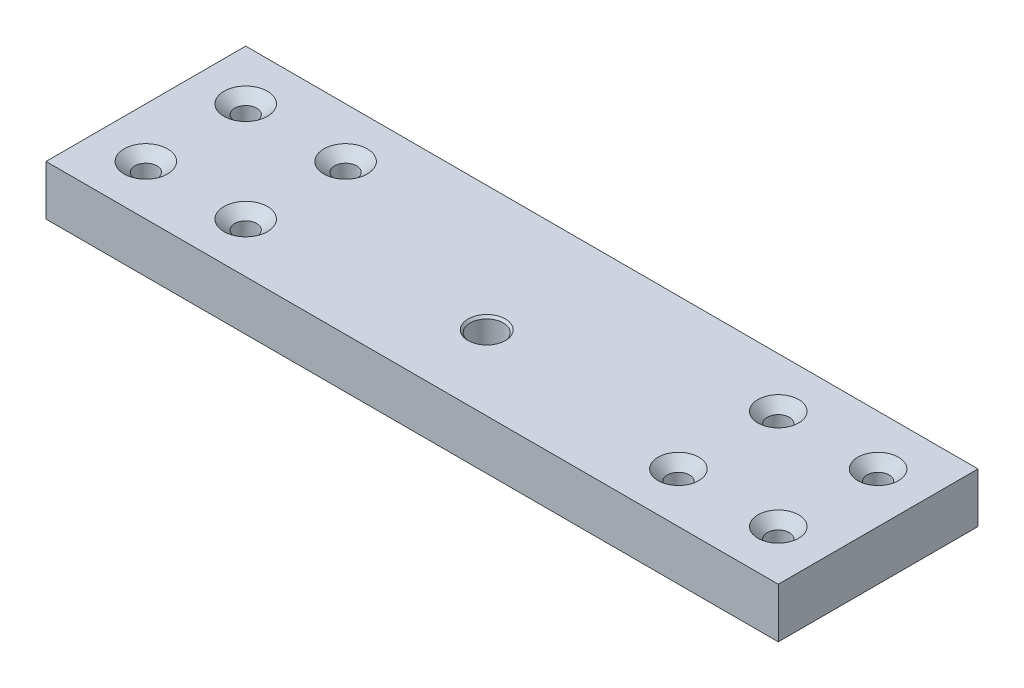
ISO-10303-21;
HEADER;
FILE_DESCRIPTION(('STEP AP214'),'2;1');
FILE_NAME('part.step','',(''),(''),'','','');
FILE_SCHEMA(('AUTOMOTIVE_DESIGN { 1 0 10303 214 1 1 1 1 }'));
ENDSEC;
DATA;
#1=APPLICATION_CONTEXT('core data for automotive mechanical design processes');
#2=APPLICATION_PROTOCOL_DEFINITION('international standard','automotive_design',2000,#1);
#3=PRODUCT_CONTEXT('',#1,'mechanical');
#4=PRODUCT('Part','Part','',(#3));
#5=PRODUCT_RELATED_PRODUCT_CATEGORY('part','',(#4));
#6=PRODUCT_DEFINITION_FORMATION('','',#4);
#7=PRODUCT_DEFINITION_CONTEXT('part definition',#1,'design');
#8=PRODUCT_DEFINITION('design','',#6,#7);
#9=PRODUCT_DEFINITION_SHAPE('','',#8);
#10=(LENGTH_UNIT() NAMED_UNIT(*) SI_UNIT(.MILLI.,.METRE.));
#11=(NAMED_UNIT(*) PLANE_ANGLE_UNIT() SI_UNIT($,.RADIAN.));
#12=(NAMED_UNIT(*) SI_UNIT($,.STERADIAN.) SOLID_ANGLE_UNIT());
#13=UNCERTAINTY_MEASURE_WITH_UNIT(LENGTH_MEASURE(1.E-05),#10,'distance_accuracy_value','');
#14=(GEOMETRIC_REPRESENTATION_CONTEXT(3) GLOBAL_UNCERTAINTY_ASSIGNED_CONTEXT((#13)) GLOBAL_UNIT_ASSIGNED_CONTEXT((#10,
#11,#12)) REPRESENTATION_CONTEXT('',''));
#15=CARTESIAN_POINT('',(0.,0.,0.));
#16=DIRECTION('',(0.,0.,1.));
#17=DIRECTION('',(1.,0.,0.));
#18=AXIS2_PLACEMENT_3D('',#15,#16,#17);
#19=CARTESIAN_POINT('',(-139.7,19.05,38.1));
#20=DIRECTION('',(0.,-1.,0.));
#21=DIRECTION('',(0.,0.,-1.));
#22=AXIS2_PLACEMENT_3D('',#19,#20,#21);
#23=PLANE('',#22);
#24=CARTESIAN_POINT('',(0.,19.05,9.64183999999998));
#25=DIRECTION('',(0.,-1.,0.));
#26=DIRECTION('',(0.,0.,-1.));
#27=AXIS2_PLACEMENT_3D('',#24,#25,#26);
#28=CIRCLE('',#27,7.14375000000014);
#29=CARTESIAN_POINT('',(0.,19.05,2.49808999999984));
#30=VERTEX_POINT('',#29);
#31=EDGE_CURVE('E131',#30,#30,#28,.T.);
#32=ORIENTED_EDGE('',*,*,#31,.T.);
#33=EDGE_LOOP('',(#32));
#34=FACE_BOUND('',#33,.T.);
#35=CARTESIAN_POINT('',(120.65,19.05,-19.05));
#36=DIRECTION('',(0.,-1.,0.));
#37=DIRECTION('',(0.,0.,-1.));
#38=AXIS2_PLACEMENT_3D('',#35,#36,#37);
#39=CIRCLE('',#38,7.77126118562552);
#40=CARTESIAN_POINT('',(120.65,19.05,-26.8212611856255));
#41=VERTEX_POINT('',#40);
#42=EDGE_CURVE('E299',#41,#41,#39,.T.);
#43=ORIENTED_EDGE('',*,*,#42,.T.);
#44=EDGE_LOOP('',(#43));
#45=FACE_BOUND('',#44,.T.);
#46=CARTESIAN_POINT('',(120.65,19.05,19.05));
#47=DIRECTION('',(0.,-1.,0.));
#48=DIRECTION('',(0.,0.,-1.));
#49=AXIS2_PLACEMENT_3D('',#46,#47,#48);
#50=CIRCLE('',#49,7.77126118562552);
#51=CARTESIAN_POINT('',(120.65,19.05,11.2787388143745));
#52=VERTEX_POINT('',#51);
#53=EDGE_CURVE('E353',#52,#52,#50,.T.);
#54=ORIENTED_EDGE('',*,*,#53,.T.);
#55=EDGE_LOOP('',(#54));
#56=FACE_BOUND('',#55,.T.);
#57=CARTESIAN_POINT('',(82.55,19.05,19.05));
#58=DIRECTION('',(0.,-1.,0.));
#59=DIRECTION('',(0.,0.,-1.));
#60=AXIS2_PLACEMENT_3D('',#57,#58,#59);
#61=CIRCLE('',#60,7.77126118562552);
#62=CARTESIAN_POINT('',(82.55,19.05,11.2787388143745));
#63=VERTEX_POINT('',#62);
#64=EDGE_CURVE('E351',#63,#63,#61,.T.);
#65=ORIENTED_EDGE('',*,*,#64,.T.);
#66=EDGE_LOOP('',(#65));
#67=FACE_BOUND('',#66,.T.);
#68=CARTESIAN_POINT('',(82.55,19.05,-19.05));
#69=DIRECTION('',(0.,-1.,0.));
#70=DIRECTION('',(0.,0.,-1.));
#71=AXIS2_PLACEMENT_3D('',#68,#69,#70);
#72=CIRCLE('',#71,7.77126118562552);
#73=CARTESIAN_POINT('',(82.55,19.05,-26.8212611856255));
#74=VERTEX_POINT('',#73);
#75=EDGE_CURVE('E354',#74,#74,#72,.T.);
#76=ORIENTED_EDGE('',*,*,#75,.T.);
#77=EDGE_LOOP('',(#76));
#78=FACE_BOUND('',#77,.T.);
#79=CARTESIAN_POINT('',(-82.55,19.05,-19.05));
#80=DIRECTION('',(0.,-1.,0.));
#81=DIRECTION('',(0.,0.,-1.));
#82=AXIS2_PLACEMENT_3D('',#79,#80,#81);
#83=CIRCLE('',#82,8.30580000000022);
#84=CARTESIAN_POINT('',(-82.55,19.05,-27.3558000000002));
#85=VERTEX_POINT('',#84);
#86=EDGE_CURVE('E359',#85,#85,#83,.T.);
#87=ORIENTED_EDGE('',*,*,#86,.T.);
#88=EDGE_LOOP('',(#87));
#89=FACE_BOUND('',#88,.T.);
#90=CARTESIAN_POINT('',(-82.55,19.05,19.05));
#91=DIRECTION('',(0.,-1.,0.));
#92=DIRECTION('',(0.,0.,-1.));
#93=AXIS2_PLACEMENT_3D('',#90,#91,#92);
#94=CIRCLE('',#93,8.30580000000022);
#95=CARTESIAN_POINT('',(-82.55,19.05,10.7441999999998));
#96=VERTEX_POINT('',#95);
#97=EDGE_CURVE('E376',#96,#96,#94,.T.);
#98=ORIENTED_EDGE('',*,*,#97,.T.);
#99=EDGE_LOOP('',(#98));
#100=FACE_BOUND('',#99,.T.);
#101=CARTESIAN_POINT('',(-120.65,19.05,19.05));
#102=DIRECTION('',(0.,-1.,0.));
#103=DIRECTION('',(0.,0.,-1.));
#104=AXIS2_PLACEMENT_3D('',#101,#102,#103);
#105=CIRCLE('',#104,8.30580000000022);
#106=CARTESIAN_POINT('',(-120.65,19.05,10.7441999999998));
#107=VERTEX_POINT('',#106);
#108=EDGE_CURVE('E380',#107,#107,#105,.T.);
#109=ORIENTED_EDGE('',*,*,#108,.T.);
#110=EDGE_LOOP('',(#109));
#111=FACE_BOUND('',#110,.T.);
#112=CARTESIAN_POINT('',(-120.65,19.05,-19.05));
#113=DIRECTION('',(0.,-1.,0.));
#114=DIRECTION('',(0.,0.,-1.));
#115=AXIS2_PLACEMENT_3D('',#112,#113,#114);
#116=CIRCLE('',#115,8.30580000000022);
#117=CARTESIAN_POINT('',(-120.65,19.05,-27.3558000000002));
#118=VERTEX_POINT('',#117);
#119=EDGE_CURVE('E383',#118,#118,#116,.T.);
#120=ORIENTED_EDGE('',*,*,#119,.T.);
#121=EDGE_LOOP('',(#120));
#122=FACE_BOUND('',#121,.T.);
#123=DIRECTION('',(1.,0.,0.));
#124=VECTOR('',#123,1.);
#125=CARTESIAN_POINT('',(0.,19.05,38.1));
#126=LINE('',#125,#124);
#127=CARTESIAN_POINT('',(-139.7,19.05,38.1));
#128=VERTEX_POINT('',#127);
#129=CARTESIAN_POINT('',(139.7,19.05,38.1));
#130=VERTEX_POINT('',#129);
#131=EDGE_CURVE('E115',#128,#130,#126,.T.);
#132=ORIENTED_EDGE('',*,*,#131,.T.);
#133=DIRECTION('',(0.,0.,1.));
#134=VECTOR('',#133,1.);
#135=CARTESIAN_POINT('',(139.7,19.05,-38.1));
#136=LINE('',#135,#134);
#137=CARTESIAN_POINT('',(139.7,19.05,-38.1));
#138=VERTEX_POINT('',#137);
#139=EDGE_CURVE('E105',#138,#130,#136,.T.);
#140=ORIENTED_EDGE('',*,*,#139,.F.);
#141=DIRECTION('',(-1.,0.,0.));
#142=VECTOR('',#141,1.);
#143=CARTESIAN_POINT('',(0.,19.05,-38.1));
#144=LINE('',#143,#142);
#145=CARTESIAN_POINT('',(-139.7,19.05,-38.1));
#146=VERTEX_POINT('',#145);
#147=EDGE_CURVE('E64',#138,#146,#144,.T.);
#148=ORIENTED_EDGE('',*,*,#147,.T.);
#149=DIRECTION('',(0.,0.,1.));
#150=VECTOR('',#149,1.);
#151=CARTESIAN_POINT('',(-139.7,19.05,-38.1));
#152=LINE('',#151,#150);
#153=EDGE_CURVE('E98',#146,#128,#152,.T.);
#154=ORIENTED_EDGE('',*,*,#153,.T.);
#155=EDGE_LOOP('',(#132,#140,#148,#154));
#156=FACE_BOUND('',#155,.T.);
#157=ADVANCED_FACE('F47',(#34,#45,#56,#67,#78,#89,#100,#111,#122,#156),#23,.F.);
#158=CARTESIAN_POINT('',(-139.7,0.,38.1));
#159=DIRECTION('',(0.,-1.,0.));
#160=DIRECTION('',(0.,0.,-1.));
#161=AXIS2_PLACEMENT_3D('',#158,#159,#160);
#162=PLANE('',#161);
#163=DIRECTION('',(0.,0.,1.));
#164=VECTOR('',#163,1.);
#165=CARTESIAN_POINT('',(139.7,0.,-38.1));
#166=LINE('',#165,#164);
#167=CARTESIAN_POINT('',(139.7,0.,-38.1));
#168=VERTEX_POINT('',#167);
#169=CARTESIAN_POINT('',(139.7,0.,38.1));
#170=VERTEX_POINT('',#169);
#171=EDGE_CURVE('E94',#168,#170,#166,.T.);
#172=ORIENTED_EDGE('',*,*,#171,.T.);
#173=DIRECTION('',(1.,0.,0.));
#174=VECTOR('',#173,1.);
#175=CARTESIAN_POINT('',(0.,0.,38.1));
#176=LINE('',#175,#174);
#177=CARTESIAN_POINT('',(-139.7,0.,38.1));
#178=VERTEX_POINT('',#177);
#179=EDGE_CURVE('E76',#178,#170,#176,.T.);
#180=ORIENTED_EDGE('',*,*,#179,.F.);
#181=DIRECTION('',(0.,0.,1.));
#182=VECTOR('',#181,1.);
#183=CARTESIAN_POINT('',(-139.7,0.,-38.1));
#184=LINE('',#183,#182);
#185=CARTESIAN_POINT('',(-139.7,0.,-38.1));
#186=VERTEX_POINT('',#185);
#187=EDGE_CURVE('E96',#186,#178,#184,.T.);
#188=ORIENTED_EDGE('',*,*,#187,.F.);
#189=DIRECTION('',(-1.,0.,0.));
#190=VECTOR('',#189,1.);
#191=CARTESIAN_POINT('',(0.,0.,-38.1));
#192=LINE('',#191,#190);
#193=EDGE_CURVE('E90',#168,#186,#192,.T.);
#194=ORIENTED_EDGE('',*,*,#193,.F.);
#195=EDGE_LOOP('',(#172,#180,#188,#194));
#196=FACE_BOUND('',#195,.T.);
#197=CARTESIAN_POINT('',(0.,0.,9.64183999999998));
#198=DIRECTION('',(0.,-1.,0.));
#199=DIRECTION('',(0.,0.,-1.));
#200=AXIS2_PLACEMENT_3D('',#197,#198,#199);
#201=CIRCLE('',#200,7.26310492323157);
#202=CARTESIAN_POINT('',(0.,0.,2.37873507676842));
#203=VERTEX_POINT('',#202);
#204=EDGE_CURVE('E158',#203,#203,#201,.F.);
#205=ORIENTED_EDGE('',*,*,#204,.T.);
#206=EDGE_LOOP('',(#205));
#207=FACE_BOUND('',#206,.T.);
#208=CARTESIAN_POINT('',(-120.65,0.,-19.05));
#209=DIRECTION('',(0.,-1.,0.));
#210=DIRECTION('',(0.,0.,-1.));
#211=AXIS2_PLACEMENT_3D('',#208,#209,#210);
#212=CIRCLE('',#211,5.12950492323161);
#213=CARTESIAN_POINT('',(-120.65,0.,-24.1795049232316));
#214=VERTEX_POINT('',#213);
#215=EDGE_CURVE('E155',#214,#214,#212,.F.);
#216=ORIENTED_EDGE('',*,*,#215,.T.);
#217=EDGE_LOOP('',(#216));
#218=FACE_BOUND('',#217,.T.);
#219=CARTESIAN_POINT('',(-120.65,0.,19.05));
#220=DIRECTION('',(0.,-1.,0.));
#221=DIRECTION('',(0.,0.,-1.));
#222=AXIS2_PLACEMENT_3D('',#219,#220,#221);
#223=CIRCLE('',#222,5.12950492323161);
#224=CARTESIAN_POINT('',(-120.65,0.,13.9204950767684));
#225=VERTEX_POINT('',#224);
#226=EDGE_CURVE('E152',#225,#225,#223,.F.);
#227=ORIENTED_EDGE('',*,*,#226,.T.);
#228=EDGE_LOOP('',(#227));
#229=FACE_BOUND('',#228,.T.);
#230=CARTESIAN_POINT('',(-82.55,0.,19.05));
#231=DIRECTION('',(0.,-1.,0.));
#232=DIRECTION('',(0.,0.,-1.));
#233=AXIS2_PLACEMENT_3D('',#230,#231,#232);
#234=CIRCLE('',#233,5.12950492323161);
#235=CARTESIAN_POINT('',(-82.55,0.,13.9204950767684));
#236=VERTEX_POINT('',#235);
#237=EDGE_CURVE('E149',#236,#236,#234,.F.);
#238=ORIENTED_EDGE('',*,*,#237,.T.);
#239=EDGE_LOOP('',(#238));
#240=FACE_BOUND('',#239,.T.);
#241=CARTESIAN_POINT('',(-82.55,0.,-19.05));
#242=DIRECTION('',(0.,-1.,0.));
#243=DIRECTION('',(0.,0.,-1.));
#244=AXIS2_PLACEMENT_3D('',#241,#242,#243);
#245=CIRCLE('',#244,5.12950492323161);
#246=CARTESIAN_POINT('',(-82.55,0.,-24.1795049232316));
#247=VERTEX_POINT('',#246);
#248=EDGE_CURVE('E146',#247,#247,#245,.F.);
#249=ORIENTED_EDGE('',*,*,#248,.T.);
#250=EDGE_LOOP('',(#249));
#251=FACE_BOUND('',#250,.T.);
#252=CARTESIAN_POINT('',(120.65,0.,19.05));
#253=DIRECTION('',(0.,-1.,0.));
#254=DIRECTION('',(0.,0.,-1.));
#255=AXIS2_PLACEMENT_3D('',#252,#253,#254);
#256=CIRCLE('',#255,5.01015000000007);
#257=CARTESIAN_POINT('',(120.65,0.,14.0398499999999));
#258=VERTEX_POINT('',#257);
#259=EDGE_CURVE('E143',#258,#258,#256,.F.);
#260=ORIENTED_EDGE('',*,*,#259,.T.);
#261=EDGE_LOOP('',(#260));
#262=FACE_BOUND('',#261,.T.);
#263=CARTESIAN_POINT('',(120.65,0.,-19.05));
#264=DIRECTION('',(0.,-1.,0.));
#265=DIRECTION('',(0.,0.,-1.));
#266=AXIS2_PLACEMENT_3D('',#263,#264,#265);
#267=CIRCLE('',#266,5.01015000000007);
#268=CARTESIAN_POINT('',(120.65,0.,-24.0601500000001));
#269=VERTEX_POINT('',#268);
#270=EDGE_CURVE('E140',#269,#269,#267,.F.);
#271=ORIENTED_EDGE('',*,*,#270,.T.);
#272=EDGE_LOOP('',(#271));
#273=FACE_BOUND('',#272,.T.);
#274=CARTESIAN_POINT('',(82.55,0.,-19.05));
#275=DIRECTION('',(0.,-1.,0.));
#276=DIRECTION('',(0.,0.,-1.));
#277=AXIS2_PLACEMENT_3D('',#274,#275,#276);
#278=CIRCLE('',#277,5.01015000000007);
#279=CARTESIAN_POINT('',(82.55,0.,-24.0601500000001));
#280=VERTEX_POINT('',#279);
#281=EDGE_CURVE('E137',#280,#280,#278,.F.);
#282=ORIENTED_EDGE('',*,*,#281,.T.);
#283=EDGE_LOOP('',(#282));
#284=FACE_BOUND('',#283,.T.);
#285=CARTESIAN_POINT('',(82.55,0.,19.05));
#286=DIRECTION('',(0.,-1.,0.));
#287=DIRECTION('',(0.,0.,-1.));
#288=AXIS2_PLACEMENT_3D('',#285,#286,#287);
#289=CIRCLE('',#288,5.01015000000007);
#290=CARTESIAN_POINT('',(82.55,0.,14.0398499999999));
#291=VERTEX_POINT('',#290);
#292=EDGE_CURVE('E134',#291,#291,#289,.F.);
#293=ORIENTED_EDGE('',*,*,#292,.T.);
#294=EDGE_LOOP('',(#293));
#295=FACE_BOUND('',#294,.T.);
#296=ADVANCED_FACE('F91',(#196,#207,#218,#229,#240,#251,#262,#273,#284,#295),#162,.T.);
#297=CARTESIAN_POINT('',(-139.7,19.05,-38.1));
#298=DIRECTION('',(1.,0.,0.));
#299=DIRECTION('',(0.,0.,-1.));
#300=AXIS2_PLACEMENT_3D('',#297,#298,#299);
#301=PLANE('',#300);
#302=ORIENTED_EDGE('',*,*,#187,.T.);
#303=DIRECTION('',(0.,-1.,0.));
#304=VECTOR('',#303,1.);
#305=CARTESIAN_POINT('',(-139.7,19.05,38.1));
#306=LINE('',#305,#304);
#307=EDGE_CURVE('E386',#128,#178,#306,.T.);
#308=ORIENTED_EDGE('',*,*,#307,.F.);
#309=ORIENTED_EDGE('',*,*,#153,.F.);
#310=DIRECTION('',(0.,-1.,0.));
#311=VECTOR('',#310,1.);
#312=CARTESIAN_POINT('',(-139.7,19.05,-38.1));
#313=LINE('',#312,#311);
#314=EDGE_CURVE('E389',#146,#186,#313,.T.);
#315=ORIENTED_EDGE('',*,*,#314,.T.);
#316=EDGE_LOOP('',(#302,#308,#309,#315));
#317=FACE_BOUND('',#316,.T.);
#318=ADVANCED_FACE('F203',(#317),#301,.F.);
#319=CARTESIAN_POINT('',(0.,19.05,38.1));
#320=DIRECTION('',(0.,0.,-1.));
#321=DIRECTION('',(-1.,0.,0.));
#322=AXIS2_PLACEMENT_3D('',#319,#320,#321);
#323=PLANE('',#322);
#324=DIRECTION('',(0.,-1.,0.));
#325=VECTOR('',#324,1.);
#326=CARTESIAN_POINT('',(139.7,19.05,38.1));
#327=LINE('',#326,#325);
#328=EDGE_CURVE('E104',#130,#170,#327,.T.);
#329=ORIENTED_EDGE('',*,*,#328,.F.);
#330=ORIENTED_EDGE('',*,*,#131,.F.);
#331=ORIENTED_EDGE('',*,*,#307,.T.);
#332=ORIENTED_EDGE('',*,*,#179,.T.);
#333=EDGE_LOOP('',(#329,#330,#331,#332));
#334=FACE_BOUND('',#333,.T.);
#335=ADVANCED_FACE('F212',(#334),#323,.F.);
#336=CARTESIAN_POINT('',(0.,19.05,-38.1));
#337=DIRECTION('',(0.,0.,1.));
#338=DIRECTION('',(1.,0.,0.));
#339=AXIS2_PLACEMENT_3D('',#336,#337,#338);
#340=PLANE('',#339);
#341=ORIENTED_EDGE('',*,*,#193,.T.);
#342=ORIENTED_EDGE('',*,*,#314,.F.);
#343=ORIENTED_EDGE('',*,*,#147,.F.);
#344=DIRECTION('',(0.,-1.,0.));
#345=VECTOR('',#344,1.);
#346=CARTESIAN_POINT('',(139.7,19.05,-38.1));
#347=LINE('',#346,#345);
#348=EDGE_CURVE('E100',#138,#168,#347,.T.);
#349=ORIENTED_EDGE('',*,*,#348,.T.);
#350=EDGE_LOOP('',(#341,#342,#343,#349));
#351=FACE_BOUND('',#350,.T.);
#352=ADVANCED_FACE('F101',(#351),#340,.F.);
#353=CARTESIAN_POINT('',(-120.65,19.05,-19.05));
#354=DIRECTION('',(0.,-1.,0.));
#355=DIRECTION('',(0.,0.,-1.));
#356=AXIS2_PLACEMENT_3D('',#353,#354,#355);
#357=CYLINDRICAL_SURFACE('',#356,4.21639999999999);
#358=CARTESIAN_POINT('',(-120.65,0.793749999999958,-19.05));
#359=DIRECTION('',(0.,-1.,0.));
#360=DIRECTION('',(0.,0.,-1.));
#361=AXIS2_PLACEMENT_3D('',#358,#359,#360);
#362=CIRCLE('',#361,4.21639999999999);
#363=CARTESIAN_POINT('',(-120.65,0.793749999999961,-23.2664));
#364=VERTEX_POINT('',#363);
#365=EDGE_CURVE('E161',#364,#364,#362,.T.);
#366=CARTESIAN_POINT('',(-120.65,15.4951388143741,-19.05));
#367=DIRECTION('',(0.,-1.,0.));
#368=DIRECTION('',(0.,0.,-1.));
#369=AXIS2_PLACEMENT_3D('',#366,#367,#368);
#370=CIRCLE('',#369,4.21639999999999);
#371=CARTESIAN_POINT('',(-120.65,15.4951388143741,-23.2664));
#372=VERTEX_POINT('',#371);
#373=EDGE_CURVE('E128',#372,#372,#370,.F.);
#374=CARTESIAN_POINT('',(-120.65,0.793749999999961,-23.2664));
#375=CARTESIAN_POINT('',(-120.65,0.946889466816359,-23.2664));
#376=CARTESIAN_POINT('',(-120.65,1.10002893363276,-23.2664));
#377=CARTESIAN_POINT('',(-120.65,1.40630786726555,-23.2664));
#378=CARTESIAN_POINT('',(-120.65,1.55944733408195,-23.2664));
#379=CARTESIAN_POINT('',(-120.65,1.86572626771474,-23.2664));
#380=CARTESIAN_POINT('',(-120.65,2.01886573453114,-23.2664));
#381=CARTESIAN_POINT('',(-120.65,2.32514466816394,-23.2664));
#382=CARTESIAN_POINT('',(-120.65,2.47828413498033,-23.2664));
#383=CARTESIAN_POINT('',(-120.65,2.78456306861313,-23.2664));
#384=CARTESIAN_POINT('',(-120.65,2.93770253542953,-23.2664));
#385=CARTESIAN_POINT('',(-120.65,3.24398146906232,-23.2664));
#386=CARTESIAN_POINT('',(-120.65,3.39712093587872,-23.2664));
#387=CARTESIAN_POINT('',(-120.65,3.70339986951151,-23.2664));
#388=CARTESIAN_POINT('',(-120.65,3.85653933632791,-23.2664));
#389=CARTESIAN_POINT('',(-120.65,4.16281826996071,-23.2664));
#390=CARTESIAN_POINT('',(-120.65,4.3159577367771,-23.2664));
#391=CARTESIAN_POINT('',(-120.65,4.6222366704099,-23.2664));
#392=CARTESIAN_POINT('',(-120.65,4.7753761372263,-23.2664));
#393=CARTESIAN_POINT('',(-120.65,5.08165507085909,-23.2664));
#394=CARTESIAN_POINT('',(-120.65,5.23479453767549,-23.2664));
#395=CARTESIAN_POINT('',(-120.65,5.54107347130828,-23.2664));
#396=CARTESIAN_POINT('',(-120.65,5.69421293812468,-23.2664));
#397=CARTESIAN_POINT('',(-120.65,6.00049187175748,-23.2664));
#398=CARTESIAN_POINT('',(-120.65,6.15363133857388,-23.2664));
#399=CARTESIAN_POINT('',(-120.65,6.45991027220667,-23.2664));
#400=CARTESIAN_POINT('',(-120.65,6.61304973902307,-23.2664));
#401=CARTESIAN_POINT('',(-120.65,6.91932867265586,-23.2664));
#402=CARTESIAN_POINT('',(-120.65,7.07246813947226,-23.2664));
#403=CARTESIAN_POINT('',(-120.65,7.37874707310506,-23.2664));
#404=CARTESIAN_POINT('',(-120.65,7.53188653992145,-23.2664));
#405=CARTESIAN_POINT('',(-120.65,7.83816547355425,-23.2664));
#406=CARTESIAN_POINT('',(-120.65,7.99130494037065,-23.2664));
#407=CARTESIAN_POINT('',(-120.65,8.29758387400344,-23.2664));
#408=CARTESIAN_POINT('',(-120.65,8.45072334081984,-23.2664));
#409=CARTESIAN_POINT('',(-120.65,8.75700227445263,-23.2664));
#410=CARTESIAN_POINT('',(-120.65,8.91014174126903,-23.2664));
#411=CARTESIAN_POINT('',(-120.65,9.21642067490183,-23.2664));
#412=CARTESIAN_POINT('',(-120.65,9.36956014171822,-23.2664));
#413=CARTESIAN_POINT('',(-120.65,9.67583907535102,-23.2664));
#414=CARTESIAN_POINT('',(-120.65,9.82897854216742,-23.2664));
#415=CARTESIAN_POINT('',(-120.65,10.1352574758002,-23.2664));
#416=CARTESIAN_POINT('',(-120.65,10.2883969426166,-23.2664));
#417=CARTESIAN_POINT('',(-120.65,10.5946758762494,-23.2664));
#418=CARTESIAN_POINT('',(-120.65,10.7478153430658,-23.2664));
#419=CARTESIAN_POINT('',(-120.65,11.0540942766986,-23.2664));
#420=CARTESIAN_POINT('',(-120.65,11.207233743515,-23.2664));
#421=CARTESIAN_POINT('',(-120.65,11.5135126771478,-23.2664));
#422=CARTESIAN_POINT('',(-120.65,11.6666521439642,-23.2664));
#423=CARTESIAN_POINT('',(-120.65,11.972931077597,-23.2664));
#424=CARTESIAN_POINT('',(-120.65,12.1260705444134,-23.2664));
#425=CARTESIAN_POINT('',(-120.65,12.4323494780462,-23.2664));
#426=CARTESIAN_POINT('',(-120.65,12.5854889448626,-23.2664));
#427=CARTESIAN_POINT('',(-120.65,12.8917678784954,-23.2664));
#428=CARTESIAN_POINT('',(-120.65,13.0449073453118,-23.2664));
#429=CARTESIAN_POINT('',(-120.65,13.3511862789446,-23.2664));
#430=CARTESIAN_POINT('',(-120.65,13.504325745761,-23.2664));
#431=CARTESIAN_POINT('',(-120.65,13.8106046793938,-23.2664));
#432=CARTESIAN_POINT('',(-120.65,13.9637441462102,-23.2664));
#433=CARTESIAN_POINT('',(-120.65,14.2700230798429,-23.2664));
#434=CARTESIAN_POINT('',(-120.65,14.4231625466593,-23.2664));
#435=CARTESIAN_POINT('',(-120.65,14.7294414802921,-23.2664));
#436=CARTESIAN_POINT('',(-120.65,14.8825809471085,-23.2664));
#437=CARTESIAN_POINT('',(-120.65,15.1888598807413,-23.2664));
#438=CARTESIAN_POINT('',(-120.65,15.3419993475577,-23.2664));
#439=CARTESIAN_POINT('',(-120.65,15.4951388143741,-23.2664));
#440=B_SPLINE_CURVE_WITH_KNOTS('',3,(#374,#375,#376,#377,#378,#379,#380,#381,#382,#383,#384,
#385,#386,#387,#388,#389,#390,#391,#392,#393,#394,#395,#396,#397,#398,#399,#400,#401,#402,#403,
#404,#405,#406,#407,#408,#409,#410,#411,#412,#413,#414,#415,#416,#417,#418,#419,#420,#421,#422,
#423,#424,#425,#426,#427,#428,#429,#430,#431,#432,#433,#434,#435,#436,#437,#438,#439),
.UNSPECIFIED.,.F.,.F.,(4,2,2,2,2,2,2,2,2,2,2,2,2,2,2,2,2,2,2,2,2,2,2,2,2,2,2,2,2,2,2,2,4),(0.,
0.459418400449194,0.918836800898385,1.37825520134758,1.83767360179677,2.29709200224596,
2.75651040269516,3.21592880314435,3.67534720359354,4.13476560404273,4.59418400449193,
5.05360240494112,5.51302080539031,5.9724392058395,6.4318576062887,6.89127600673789,
7.35069440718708,7.81011280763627,8.26953120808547,8.72894960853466,9.18836800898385,
9.64778640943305,10.1072048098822,10.5666232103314,11.0260416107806,11.4854600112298,
11.944878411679,12.4042968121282,12.8637152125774,13.3231336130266,13.7825520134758,
14.241970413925,14.7013888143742),.UNSPECIFIED.);
#441=EDGE_CURVE('BSEAM207',#364,#372,#440,.T.);
#442=ORIENTED_EDGE('',*,*,#365,.T.);
#443=ORIENTED_EDGE('',*,*,#373,.T.);
#444=ORIENTED_EDGE('',*,*,#441,.T.);
#445=ORIENTED_EDGE('',*,*,#441,.F.);
#446=EDGE_LOOP('',(#442,#444,#443,#445));
#447=FACE_BOUND('',#446,.T.);
#448=ADVANCED_FACE('F207',(#447),#357,.F.);
#449=CARTESIAN_POINT('',(-82.55,19.05,-19.05));
#450=DIRECTION('',(0.,-1.,0.));
#451=DIRECTION('',(0.,0.,-1.));
#452=AXIS2_PLACEMENT_3D('',#449,#450,#451);
#453=CYLINDRICAL_SURFACE('',#452,4.21639999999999);
#454=CARTESIAN_POINT('',(-82.55,0.793749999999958,-19.05));
#455=DIRECTION('',(0.,-1.,0.));
#456=DIRECTION('',(0.,0.,-1.));
#457=AXIS2_PLACEMENT_3D('',#454,#455,#456);
#458=CIRCLE('',#457,4.21639999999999);
#459=CARTESIAN_POINT('',(-82.55,0.793749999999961,-23.2664));
#460=VERTEX_POINT('',#459);
#461=EDGE_CURVE('E170',#460,#460,#458,.T.);
#462=CARTESIAN_POINT('',(-82.55,15.4951388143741,-19.05));
#463=DIRECTION('',(0.,-1.,0.));
#464=DIRECTION('',(0.,0.,-1.));
#465=AXIS2_PLACEMENT_3D('',#462,#463,#464);
#466=CIRCLE('',#465,4.21639999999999);
#467=CARTESIAN_POINT('',(-82.55,15.4951388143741,-23.2664));
#468=VERTEX_POINT('',#467);
#469=EDGE_CURVE('E305',#468,#468,#466,.F.);
#470=CARTESIAN_POINT('',(-82.55,0.793749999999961,-23.2664));
#471=CARTESIAN_POINT('',(-82.55,0.946889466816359,-23.2664));
#472=CARTESIAN_POINT('',(-82.55,1.10002893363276,-23.2664));
#473=CARTESIAN_POINT('',(-82.55,1.40630786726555,-23.2664));
#474=CARTESIAN_POINT('',(-82.55,1.55944733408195,-23.2664));
#475=CARTESIAN_POINT('',(-82.55,1.86572626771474,-23.2664));
#476=CARTESIAN_POINT('',(-82.55,2.01886573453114,-23.2664));
#477=CARTESIAN_POINT('',(-82.55,2.32514466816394,-23.2664));
#478=CARTESIAN_POINT('',(-82.55,2.47828413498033,-23.2664));
#479=CARTESIAN_POINT('',(-82.55,2.78456306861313,-23.2664));
#480=CARTESIAN_POINT('',(-82.55,2.93770253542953,-23.2664));
#481=CARTESIAN_POINT('',(-82.55,3.24398146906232,-23.2664));
#482=CARTESIAN_POINT('',(-82.55,3.39712093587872,-23.2664));
#483=CARTESIAN_POINT('',(-82.55,3.70339986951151,-23.2664));
#484=CARTESIAN_POINT('',(-82.55,3.85653933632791,-23.2664));
#485=CARTESIAN_POINT('',(-82.55,4.16281826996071,-23.2664));
#486=CARTESIAN_POINT('',(-82.55,4.3159577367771,-23.2664));
#487=CARTESIAN_POINT('',(-82.55,4.6222366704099,-23.2664));
#488=CARTESIAN_POINT('',(-82.55,4.7753761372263,-23.2664));
#489=CARTESIAN_POINT('',(-82.55,5.08165507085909,-23.2664));
#490=CARTESIAN_POINT('',(-82.55,5.23479453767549,-23.2664));
#491=CARTESIAN_POINT('',(-82.55,5.54107347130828,-23.2664));
#492=CARTESIAN_POINT('',(-82.55,5.69421293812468,-23.2664));
#493=CARTESIAN_POINT('',(-82.55,6.00049187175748,-23.2664));
#494=CARTESIAN_POINT('',(-82.55,6.15363133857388,-23.2664));
#495=CARTESIAN_POINT('',(-82.55,6.45991027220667,-23.2664));
#496=CARTESIAN_POINT('',(-82.55,6.61304973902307,-23.2664));
#497=CARTESIAN_POINT('',(-82.55,6.91932867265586,-23.2664));
#498=CARTESIAN_POINT('',(-82.55,7.07246813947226,-23.2664));
#499=CARTESIAN_POINT('',(-82.55,7.37874707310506,-23.2664));
#500=CARTESIAN_POINT('',(-82.55,7.53188653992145,-23.2664));
#501=CARTESIAN_POINT('',(-82.55,7.83816547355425,-23.2664));
#502=CARTESIAN_POINT('',(-82.55,7.99130494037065,-23.2664));
#503=CARTESIAN_POINT('',(-82.55,8.29758387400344,-23.2664));
#504=CARTESIAN_POINT('',(-82.55,8.45072334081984,-23.2664));
#505=CARTESIAN_POINT('',(-82.55,8.75700227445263,-23.2664));
#506=CARTESIAN_POINT('',(-82.55,8.91014174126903,-23.2664));
#507=CARTESIAN_POINT('',(-82.55,9.21642067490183,-23.2664));
#508=CARTESIAN_POINT('',(-82.55,9.36956014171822,-23.2664));
#509=CARTESIAN_POINT('',(-82.55,9.67583907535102,-23.2664));
#510=CARTESIAN_POINT('',(-82.55,9.82897854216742,-23.2664));
#511=CARTESIAN_POINT('',(-82.55,10.1352574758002,-23.2664));
#512=CARTESIAN_POINT('',(-82.55,10.2883969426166,-23.2664));
#513=CARTESIAN_POINT('',(-82.55,10.5946758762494,-23.2664));
#514=CARTESIAN_POINT('',(-82.55,10.7478153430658,-23.2664));
#515=CARTESIAN_POINT('',(-82.55,11.0540942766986,-23.2664));
#516=CARTESIAN_POINT('',(-82.55,11.207233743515,-23.2664));
#517=CARTESIAN_POINT('',(-82.55,11.5135126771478,-23.2664));
#518=CARTESIAN_POINT('',(-82.55,11.6666521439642,-23.2664));
#519=CARTESIAN_POINT('',(-82.55,11.972931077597,-23.2664));
#520=CARTESIAN_POINT('',(-82.55,12.1260705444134,-23.2664));
#521=CARTESIAN_POINT('',(-82.55,12.4323494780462,-23.2664));
#522=CARTESIAN_POINT('',(-82.55,12.5854889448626,-23.2664));
#523=CARTESIAN_POINT('',(-82.55,12.8917678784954,-23.2664));
#524=CARTESIAN_POINT('',(-82.55,13.0449073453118,-23.2664));
#525=CARTESIAN_POINT('',(-82.55,13.3511862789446,-23.2664));
#526=CARTESIAN_POINT('',(-82.55,13.504325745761,-23.2664));
#527=CARTESIAN_POINT('',(-82.55,13.8106046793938,-23.2664));
#528=CARTESIAN_POINT('',(-82.55,13.9637441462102,-23.2664));
#529=CARTESIAN_POINT('',(-82.55,14.2700230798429,-23.2664));
#530=CARTESIAN_POINT('',(-82.55,14.4231625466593,-23.2664));
#531=CARTESIAN_POINT('',(-82.55,14.7294414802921,-23.2664));
#532=CARTESIAN_POINT('',(-82.55,14.8825809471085,-23.2664));
#533=CARTESIAN_POINT('',(-82.55,15.1888598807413,-23.2664));
#534=CARTESIAN_POINT('',(-82.55,15.3419993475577,-23.2664));
#535=CARTESIAN_POINT('',(-82.55,15.4951388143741,-23.2664));
#536=B_SPLINE_CURVE_WITH_KNOTS('',3,(#470,#471,#472,#473,#474,#475,#476,#477,#478,#479,#480,
#481,#482,#483,#484,#485,#486,#487,#488,#489,#490,#491,#492,#493,#494,#495,#496,#497,#498,#499,
#500,#501,#502,#503,#504,#505,#506,#507,#508,#509,#510,#511,#512,#513,#514,#515,#516,#517,#518,
#519,#520,#521,#522,#523,#524,#525,#526,#527,#528,#529,#530,#531,#532,#533,#534,#535),
.UNSPECIFIED.,.F.,.F.,(4,2,2,2,2,2,2,2,2,2,2,2,2,2,2,2,2,2,2,2,2,2,2,2,2,2,2,2,2,2,2,2,4),(0.,
0.459418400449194,0.918836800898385,1.37825520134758,1.83767360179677,2.29709200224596,
2.75651040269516,3.21592880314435,3.67534720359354,4.13476560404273,4.59418400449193,
5.05360240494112,5.51302080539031,5.9724392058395,6.4318576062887,6.89127600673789,
7.35069440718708,7.81011280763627,8.26953120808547,8.72894960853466,9.18836800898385,
9.64778640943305,10.1072048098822,10.5666232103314,11.0260416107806,11.4854600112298,
11.944878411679,12.4042968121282,12.8637152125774,13.3231336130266,13.7825520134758,
14.241970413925,14.7013888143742),.UNSPECIFIED.);
#537=EDGE_CURVE('BSEAM318',#460,#468,#536,.T.);
#538=ORIENTED_EDGE('',*,*,#461,.T.);
#539=ORIENTED_EDGE('',*,*,#469,.T.);
#540=ORIENTED_EDGE('',*,*,#537,.T.);
#541=ORIENTED_EDGE('',*,*,#537,.F.);
#542=EDGE_LOOP('',(#538,#540,#539,#541));
#543=FACE_BOUND('',#542,.T.);
#544=ADVANCED_FACE('F318',(#543),#453,.F.);
#545=CARTESIAN_POINT('',(-82.55,19.05,19.05));
#546=DIRECTION('',(0.,-1.,0.));
#547=DIRECTION('',(0.,0.,-1.));
#548=AXIS2_PLACEMENT_3D('',#545,#546,#547);
#549=CYLINDRICAL_SURFACE('',#548,4.21639999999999);
#550=CARTESIAN_POINT('',(-82.55,0.793749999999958,19.05));
#551=DIRECTION('',(0.,-1.,0.));
#552=DIRECTION('',(0.,0.,-1.));
#553=AXIS2_PLACEMENT_3D('',#550,#551,#552);
#554=CIRCLE('',#553,4.21639999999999);
#555=CARTESIAN_POINT('',(-82.55,0.793749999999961,14.8336));
#556=VERTEX_POINT('',#555);
#557=EDGE_CURVE('E167',#556,#556,#554,.T.);
#558=CARTESIAN_POINT('',(-82.55,15.4951388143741,19.05));
#559=DIRECTION('',(0.,-1.,0.));
#560=DIRECTION('',(0.,0.,-1.));
#561=AXIS2_PLACEMENT_3D('',#558,#559,#560);
#562=CIRCLE('',#561,4.21639999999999);
#563=CARTESIAN_POINT('',(-82.55,15.4951388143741,14.8336));
#564=VERTEX_POINT('',#563);
#565=EDGE_CURVE('E308',#564,#564,#562,.F.);
#566=CARTESIAN_POINT('',(-82.55,0.793749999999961,14.8336));
#567=CARTESIAN_POINT('',(-82.55,0.946889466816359,14.8336));
#568=CARTESIAN_POINT('',(-82.55,1.10002893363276,14.8336));
#569=CARTESIAN_POINT('',(-82.55,1.40630786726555,14.8336));
#570=CARTESIAN_POINT('',(-82.55,1.55944733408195,14.8336));
#571=CARTESIAN_POINT('',(-82.55,1.86572626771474,14.8336));
#572=CARTESIAN_POINT('',(-82.55,2.01886573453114,14.8336));
#573=CARTESIAN_POINT('',(-82.55,2.32514466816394,14.8336));
#574=CARTESIAN_POINT('',(-82.55,2.47828413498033,14.8336));
#575=CARTESIAN_POINT('',(-82.55,2.78456306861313,14.8336));
#576=CARTESIAN_POINT('',(-82.55,2.93770253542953,14.8336));
#577=CARTESIAN_POINT('',(-82.55,3.24398146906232,14.8336));
#578=CARTESIAN_POINT('',(-82.55,3.39712093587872,14.8336));
#579=CARTESIAN_POINT('',(-82.55,3.70339986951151,14.8336));
#580=CARTESIAN_POINT('',(-82.55,3.85653933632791,14.8336));
#581=CARTESIAN_POINT('',(-82.55,4.16281826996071,14.8336));
#582=CARTESIAN_POINT('',(-82.55,4.3159577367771,14.8336));
#583=CARTESIAN_POINT('',(-82.55,4.6222366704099,14.8336));
#584=CARTESIAN_POINT('',(-82.55,4.7753761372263,14.8336));
#585=CARTESIAN_POINT('',(-82.55,5.08165507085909,14.8336));
#586=CARTESIAN_POINT('',(-82.55,5.23479453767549,14.8336));
#587=CARTESIAN_POINT('',(-82.55,5.54107347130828,14.8336));
#588=CARTESIAN_POINT('',(-82.55,5.69421293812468,14.8336));
#589=CARTESIAN_POINT('',(-82.55,6.00049187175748,14.8336));
#590=CARTESIAN_POINT('',(-82.55,6.15363133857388,14.8336));
#591=CARTESIAN_POINT('',(-82.55,6.45991027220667,14.8336));
#592=CARTESIAN_POINT('',(-82.55,6.61304973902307,14.8336));
#593=CARTESIAN_POINT('',(-82.55,6.91932867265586,14.8336));
#594=CARTESIAN_POINT('',(-82.55,7.07246813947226,14.8336));
#595=CARTESIAN_POINT('',(-82.55,7.37874707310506,14.8336));
#596=CARTESIAN_POINT('',(-82.55,7.53188653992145,14.8336));
#597=CARTESIAN_POINT('',(-82.55,7.83816547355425,14.8336));
#598=CARTESIAN_POINT('',(-82.55,7.99130494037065,14.8336));
#599=CARTESIAN_POINT('',(-82.55,8.29758387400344,14.8336));
#600=CARTESIAN_POINT('',(-82.55,8.45072334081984,14.8336));
#601=CARTESIAN_POINT('',(-82.55,8.75700227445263,14.8336));
#602=CARTESIAN_POINT('',(-82.55,8.91014174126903,14.8336));
#603=CARTESIAN_POINT('',(-82.55,9.21642067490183,14.8336));
#604=CARTESIAN_POINT('',(-82.55,9.36956014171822,14.8336));
#605=CARTESIAN_POINT('',(-82.55,9.67583907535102,14.8336));
#606=CARTESIAN_POINT('',(-82.55,9.82897854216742,14.8336));
#607=CARTESIAN_POINT('',(-82.55,10.1352574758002,14.8336));
#608=CARTESIAN_POINT('',(-82.55,10.2883969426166,14.8336));
#609=CARTESIAN_POINT('',(-82.55,10.5946758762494,14.8336));
#610=CARTESIAN_POINT('',(-82.55,10.7478153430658,14.8336));
#611=CARTESIAN_POINT('',(-82.55,11.0540942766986,14.8336));
#612=CARTESIAN_POINT('',(-82.55,11.207233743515,14.8336));
#613=CARTESIAN_POINT('',(-82.55,11.5135126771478,14.8336));
#614=CARTESIAN_POINT('',(-82.55,11.6666521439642,14.8336));
#615=CARTESIAN_POINT('',(-82.55,11.972931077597,14.8336));
#616=CARTESIAN_POINT('',(-82.55,12.1260705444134,14.8336));
#617=CARTESIAN_POINT('',(-82.55,12.4323494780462,14.8336));
#618=CARTESIAN_POINT('',(-82.55,12.5854889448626,14.8336));
#619=CARTESIAN_POINT('',(-82.55,12.8917678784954,14.8336));
#620=CARTESIAN_POINT('',(-82.55,13.0449073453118,14.8336));
#621=CARTESIAN_POINT('',(-82.55,13.3511862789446,14.8336));
#622=CARTESIAN_POINT('',(-82.55,13.504325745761,14.8336));
#623=CARTESIAN_POINT('',(-82.55,13.8106046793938,14.8336));
#624=CARTESIAN_POINT('',(-82.55,13.9637441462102,14.8336));
#625=CARTESIAN_POINT('',(-82.55,14.2700230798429,14.8336));
#626=CARTESIAN_POINT('',(-82.55,14.4231625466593,14.8336));
#627=CARTESIAN_POINT('',(-82.55,14.7294414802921,14.8336));
#628=CARTESIAN_POINT('',(-82.55,14.8825809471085,14.8336));
#629=CARTESIAN_POINT('',(-82.55,15.1888598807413,14.8336));
#630=CARTESIAN_POINT('',(-82.55,15.3419993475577,14.8336));
#631=CARTESIAN_POINT('',(-82.55,15.4951388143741,14.8336));
#632=B_SPLINE_CURVE_WITH_KNOTS('',3,(#566,#567,#568,#569,#570,#571,#572,#573,#574,#575,#576,
#577,#578,#579,#580,#581,#582,#583,#584,#585,#586,#587,#588,#589,#590,#591,#592,#593,#594,#595,
#596,#597,#598,#599,#600,#601,#602,#603,#604,#605,#606,#607,#608,#609,#610,#611,#612,#613,#614,
#615,#616,#617,#618,#619,#620,#621,#622,#623,#624,#625,#626,#627,#628,#629,#630,#631),
.UNSPECIFIED.,.F.,.F.,(4,2,2,2,2,2,2,2,2,2,2,2,2,2,2,2,2,2,2,2,2,2,2,2,2,2,2,2,2,2,2,2,4),(0.,
0.459418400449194,0.918836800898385,1.37825520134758,1.83767360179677,2.29709200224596,
2.75651040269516,3.21592880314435,3.67534720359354,4.13476560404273,4.59418400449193,
5.05360240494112,5.51302080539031,5.9724392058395,6.4318576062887,6.89127600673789,
7.35069440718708,7.81011280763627,8.26953120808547,8.72894960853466,9.18836800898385,
9.64778640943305,10.1072048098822,10.5666232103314,11.0260416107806,11.4854600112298,
11.944878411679,12.4042968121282,12.8637152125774,13.3231336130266,13.7825520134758,
14.241970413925,14.7013888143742),.UNSPECIFIED.);
#633=EDGE_CURVE('BSEAM323',#556,#564,#632,.T.);
#634=ORIENTED_EDGE('',*,*,#557,.T.);
#635=ORIENTED_EDGE('',*,*,#565,.T.);
#636=ORIENTED_EDGE('',*,*,#633,.T.);
#637=ORIENTED_EDGE('',*,*,#633,.F.);
#638=EDGE_LOOP('',(#634,#636,#635,#637));
#639=FACE_BOUND('',#638,.T.);
#640=ADVANCED_FACE('F323',(#639),#549,.F.);
#641=CARTESIAN_POINT('',(-120.65,19.05,19.05));
#642=DIRECTION('',(0.,-1.,0.));
#643=DIRECTION('',(0.,0.,-1.));
#644=AXIS2_PLACEMENT_3D('',#641,#642,#643);
#645=CYLINDRICAL_SURFACE('',#644,4.21639999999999);
#646=CARTESIAN_POINT('',(-120.65,0.793749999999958,19.05));
#647=DIRECTION('',(0.,-1.,0.));
#648=DIRECTION('',(0.,0.,-1.));
#649=AXIS2_PLACEMENT_3D('',#646,#647,#648);
#650=CIRCLE('',#649,4.21639999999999);
#651=CARTESIAN_POINT('',(-120.65,0.793749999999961,14.8336));
#652=VERTEX_POINT('',#651);
#653=EDGE_CURVE('E164',#652,#652,#650,.T.);
#654=CARTESIAN_POINT('',(-120.65,15.4951388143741,19.05));
#655=DIRECTION('',(0.,-1.,0.));
#656=DIRECTION('',(0.,0.,-1.));
#657=AXIS2_PLACEMENT_3D('',#654,#655,#656);
#658=CIRCLE('',#657,4.21639999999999);
#659=CARTESIAN_POINT('',(-120.65,15.4951388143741,14.8336));
#660=VERTEX_POINT('',#659);
#661=EDGE_CURVE('E311',#660,#660,#658,.F.);
#662=CARTESIAN_POINT('',(-120.65,0.793749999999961,14.8336));
#663=CARTESIAN_POINT('',(-120.65,0.946889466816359,14.8336));
#664=CARTESIAN_POINT('',(-120.65,1.10002893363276,14.8336));
#665=CARTESIAN_POINT('',(-120.65,1.40630786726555,14.8336));
#666=CARTESIAN_POINT('',(-120.65,1.55944733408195,14.8336));
#667=CARTESIAN_POINT('',(-120.65,1.86572626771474,14.8336));
#668=CARTESIAN_POINT('',(-120.65,2.01886573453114,14.8336));
#669=CARTESIAN_POINT('',(-120.65,2.32514466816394,14.8336));
#670=CARTESIAN_POINT('',(-120.65,2.47828413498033,14.8336));
#671=CARTESIAN_POINT('',(-120.65,2.78456306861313,14.8336));
#672=CARTESIAN_POINT('',(-120.65,2.93770253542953,14.8336));
#673=CARTESIAN_POINT('',(-120.65,3.24398146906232,14.8336));
#674=CARTESIAN_POINT('',(-120.65,3.39712093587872,14.8336));
#675=CARTESIAN_POINT('',(-120.65,3.70339986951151,14.8336));
#676=CARTESIAN_POINT('',(-120.65,3.85653933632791,14.8336));
#677=CARTESIAN_POINT('',(-120.65,4.16281826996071,14.8336));
#678=CARTESIAN_POINT('',(-120.65,4.3159577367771,14.8336));
#679=CARTESIAN_POINT('',(-120.65,4.6222366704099,14.8336));
#680=CARTESIAN_POINT('',(-120.65,4.7753761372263,14.8336));
#681=CARTESIAN_POINT('',(-120.65,5.08165507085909,14.8336));
#682=CARTESIAN_POINT('',(-120.65,5.23479453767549,14.8336));
#683=CARTESIAN_POINT('',(-120.65,5.54107347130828,14.8336));
#684=CARTESIAN_POINT('',(-120.65,5.69421293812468,14.8336));
#685=CARTESIAN_POINT('',(-120.65,6.00049187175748,14.8336));
#686=CARTESIAN_POINT('',(-120.65,6.15363133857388,14.8336));
#687=CARTESIAN_POINT('',(-120.65,6.45991027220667,14.8336));
#688=CARTESIAN_POINT('',(-120.65,6.61304973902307,14.8336));
#689=CARTESIAN_POINT('',(-120.65,6.91932867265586,14.8336));
#690=CARTESIAN_POINT('',(-120.65,7.07246813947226,14.8336));
#691=CARTESIAN_POINT('',(-120.65,7.37874707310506,14.8336));
#692=CARTESIAN_POINT('',(-120.65,7.53188653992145,14.8336));
#693=CARTESIAN_POINT('',(-120.65,7.83816547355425,14.8336));
#694=CARTESIAN_POINT('',(-120.65,7.99130494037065,14.8336));
#695=CARTESIAN_POINT('',(-120.65,8.29758387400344,14.8336));
#696=CARTESIAN_POINT('',(-120.65,8.45072334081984,14.8336));
#697=CARTESIAN_POINT('',(-120.65,8.75700227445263,14.8336));
#698=CARTESIAN_POINT('',(-120.65,8.91014174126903,14.8336));
#699=CARTESIAN_POINT('',(-120.65,9.21642067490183,14.8336));
#700=CARTESIAN_POINT('',(-120.65,9.36956014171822,14.8336));
#701=CARTESIAN_POINT('',(-120.65,9.67583907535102,14.8336));
#702=CARTESIAN_POINT('',(-120.65,9.82897854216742,14.8336));
#703=CARTESIAN_POINT('',(-120.65,10.1352574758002,14.8336));
#704=CARTESIAN_POINT('',(-120.65,10.2883969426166,14.8336));
#705=CARTESIAN_POINT('',(-120.65,10.5946758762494,14.8336));
#706=CARTESIAN_POINT('',(-120.65,10.7478153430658,14.8336));
#707=CARTESIAN_POINT('',(-120.65,11.0540942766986,14.8336));
#708=CARTESIAN_POINT('',(-120.65,11.207233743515,14.8336));
#709=CARTESIAN_POINT('',(-120.65,11.5135126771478,14.8336));
#710=CARTESIAN_POINT('',(-120.65,11.6666521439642,14.8336));
#711=CARTESIAN_POINT('',(-120.65,11.972931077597,14.8336));
#712=CARTESIAN_POINT('',(-120.65,12.1260705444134,14.8336));
#713=CARTESIAN_POINT('',(-120.65,12.4323494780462,14.8336));
#714=CARTESIAN_POINT('',(-120.65,12.5854889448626,14.8336));
#715=CARTESIAN_POINT('',(-120.65,12.8917678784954,14.8336));
#716=CARTESIAN_POINT('',(-120.65,13.0449073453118,14.8336));
#717=CARTESIAN_POINT('',(-120.65,13.3511862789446,14.8336));
#718=CARTESIAN_POINT('',(-120.65,13.504325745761,14.8336));
#719=CARTESIAN_POINT('',(-120.65,13.8106046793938,14.8336));
#720=CARTESIAN_POINT('',(-120.65,13.9637441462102,14.8336));
#721=CARTESIAN_POINT('',(-120.65,14.2700230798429,14.8336));
#722=CARTESIAN_POINT('',(-120.65,14.4231625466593,14.8336));
#723=CARTESIAN_POINT('',(-120.65,14.7294414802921,14.8336));
#724=CARTESIAN_POINT('',(-120.65,14.8825809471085,14.8336));
#725=CARTESIAN_POINT('',(-120.65,15.1888598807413,14.8336));
#726=CARTESIAN_POINT('',(-120.65,15.3419993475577,14.8336));
#727=CARTESIAN_POINT('',(-120.65,15.4951388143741,14.8336));
#728=B_SPLINE_CURVE_WITH_KNOTS('',3,(#662,#663,#664,#665,#666,#667,#668,#669,#670,#671,#672,
#673,#674,#675,#676,#677,#678,#679,#680,#681,#682,#683,#684,#685,#686,#687,#688,#689,#690,#691,
#692,#693,#694,#695,#696,#697,#698,#699,#700,#701,#702,#703,#704,#705,#706,#707,#708,#709,#710,
#711,#712,#713,#714,#715,#716,#717,#718,#719,#720,#721,#722,#723,#724,#725,#726,#727),
.UNSPECIFIED.,.F.,.F.,(4,2,2,2,2,2,2,2,2,2,2,2,2,2,2,2,2,2,2,2,2,2,2,2,2,2,2,2,2,2,2,2,4),(0.,
0.459418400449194,0.918836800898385,1.37825520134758,1.83767360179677,2.29709200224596,
2.75651040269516,3.21592880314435,3.67534720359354,4.13476560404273,4.59418400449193,
5.05360240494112,5.51302080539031,5.9724392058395,6.4318576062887,6.89127600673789,
7.35069440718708,7.81011280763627,8.26953120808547,8.72894960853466,9.18836800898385,
9.64778640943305,10.1072048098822,10.5666232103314,11.0260416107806,11.4854600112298,
11.944878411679,12.4042968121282,12.8637152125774,13.3231336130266,13.7825520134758,
14.241970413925,14.7013888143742),.UNSPECIFIED.);
#729=EDGE_CURVE('BSEAM397',#652,#660,#728,.T.);
#730=ORIENTED_EDGE('',*,*,#653,.T.);
#731=ORIENTED_EDGE('',*,*,#661,.T.);
#732=ORIENTED_EDGE('',*,*,#729,.T.);
#733=ORIENTED_EDGE('',*,*,#729,.F.);
#734=EDGE_LOOP('',(#730,#732,#731,#733));
#735=FACE_BOUND('',#734,.T.);
#736=ADVANCED_FACE('F397',(#735),#645,.F.);
#737=CARTESIAN_POINT('',(139.7,19.05,-38.1));
#738=DIRECTION('',(-1.,0.,0.));
#739=DIRECTION('',(0.,0.,-1.));
#740=AXIS2_PLACEMENT_3D('',#737,#738,#739);
#741=PLANE('',#740);
#742=ORIENTED_EDGE('',*,*,#171,.F.);
#743=ORIENTED_EDGE('',*,*,#348,.F.);
#744=ORIENTED_EDGE('',*,*,#139,.T.);
#745=ORIENTED_EDGE('',*,*,#328,.T.);
#746=EDGE_LOOP('',(#742,#743,#744,#745));
#747=FACE_BOUND('',#746,.T.);
#748=ADVANCED_FACE('F108',(#747),#741,.F.);
#749=CARTESIAN_POINT('',(120.65,19.05,-19.05));
#750=DIRECTION('',(0.,-1.,0.));
#751=DIRECTION('',(0.,0.,-1.));
#752=AXIS2_PLACEMENT_3D('',#749,#750,#751);
#753=CYLINDRICAL_SURFACE('',#752,4.21639999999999);
#754=CARTESIAN_POINT('',(120.65,0.913104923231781,-19.05));
#755=DIRECTION('',(0.,-1.,0.));
#756=DIRECTION('',(0.,0.,-1.));
#757=AXIS2_PLACEMENT_3D('',#754,#755,#756);
#758=CIRCLE('',#757,4.21639999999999);
#759=CARTESIAN_POINT('',(120.65,0.913104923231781,-23.2664));
#760=VERTEX_POINT('',#759);
#761=EDGE_CURVE('E176',#760,#760,#758,.T.);
#762=CARTESIAN_POINT('',(120.65,14.9606000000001,-19.05));
#763=DIRECTION('',(0.,-1.,0.));
#764=DIRECTION('',(0.,0.,-1.));
#765=AXIS2_PLACEMENT_3D('',#762,#763,#764);
#766=CIRCLE('',#765,4.21639999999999);
#767=CARTESIAN_POINT('',(120.65,14.9606000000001,-23.2664));
#768=VERTEX_POINT('',#767);
#769=EDGE_CURVE('E293',#768,#768,#766,.F.);
#770=CARTESIAN_POINT('',(120.65,0.913104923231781,-23.2664));
#771=CARTESIAN_POINT('',(120.65,1.05943299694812,-23.2664));
#772=CARTESIAN_POINT('',(120.65,1.20576107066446,-23.2664));
#773=CARTESIAN_POINT('',(120.65,1.49841721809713,-23.2664));
#774=CARTESIAN_POINT('',(120.65,1.64474529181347,-23.2664));
#775=CARTESIAN_POINT('',(120.65,1.93740143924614,-23.2664));
#776=CARTESIAN_POINT('',(120.65,2.08372951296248,-23.2664));
#777=CARTESIAN_POINT('',(120.65,2.37638566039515,-23.2664));
#778=CARTESIAN_POINT('',(120.65,2.52271373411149,-23.2664));
#779=CARTESIAN_POINT('',(120.65,2.81536988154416,-23.2664));
#780=CARTESIAN_POINT('',(120.65,2.9616979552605,-23.2664));
#781=CARTESIAN_POINT('',(120.65,3.25435410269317,-23.2664));
#782=CARTESIAN_POINT('',(120.65,3.40068217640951,-23.2664));
#783=CARTESIAN_POINT('',(120.65,3.69333832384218,-23.2664));
#784=CARTESIAN_POINT('',(120.65,3.83966639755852,-23.2664));
#785=CARTESIAN_POINT('',(120.65,4.13232254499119,-23.2664));
#786=CARTESIAN_POINT('',(120.65,4.27865061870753,-23.2664));
#787=CARTESIAN_POINT('',(120.65,4.57130676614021,-23.2664));
#788=CARTESIAN_POINT('',(120.65,4.71763483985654,-23.2664));
#789=CARTESIAN_POINT('',(120.65,5.01029098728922,-23.2664));
#790=CARTESIAN_POINT('',(120.65,5.15661906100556,-23.2664));
#791=CARTESIAN_POINT('',(120.65,5.44927520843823,-23.2664));
#792=CARTESIAN_POINT('',(120.65,5.59560328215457,-23.2664));
#793=CARTESIAN_POINT('',(120.65,5.88825942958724,-23.2664));
#794=CARTESIAN_POINT('',(120.65,6.03458750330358,-23.2664));
#795=CARTESIAN_POINT('',(120.65,6.32724365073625,-23.2664));
#796=CARTESIAN_POINT('',(120.65,6.47357172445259,-23.2664));
#797=CARTESIAN_POINT('',(120.65,6.76622787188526,-23.2664));
#798=CARTESIAN_POINT('',(120.65,6.9125559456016,-23.2664));
#799=CARTESIAN_POINT('',(120.65,7.20521209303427,-23.2664));
#800=CARTESIAN_POINT('',(120.65,7.35154016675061,-23.2664));
#801=CARTESIAN_POINT('',(120.65,7.64419631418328,-23.2664));
#802=CARTESIAN_POINT('',(120.65,7.79052438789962,-23.2664));
#803=CARTESIAN_POINT('',(120.65,8.0831805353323,-23.2664));
#804=CARTESIAN_POINT('',(120.65,8.22950860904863,-23.2664));
#805=CARTESIAN_POINT('',(120.65,8.52216475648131,-23.2664));
#806=CARTESIAN_POINT('',(120.65,8.66849283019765,-23.2664));
#807=CARTESIAN_POINT('',(120.65,8.96114897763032,-23.2664));
#808=CARTESIAN_POINT('',(120.65,9.10747705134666,-23.2664));
#809=CARTESIAN_POINT('',(120.65,9.40013319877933,-23.2664));
#810=CARTESIAN_POINT('',(120.65,9.54646127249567,-23.2664));
#811=CARTESIAN_POINT('',(120.65,9.83911741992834,-23.2664));
#812=CARTESIAN_POINT('',(120.65,9.98544549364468,-23.2664));
#813=CARTESIAN_POINT('',(120.65,10.2781016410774,-23.2664));
#814=CARTESIAN_POINT('',(120.65,10.4244297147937,-23.2664));
#815=CARTESIAN_POINT('',(120.65,10.7170858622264,-23.2664));
#816=CARTESIAN_POINT('',(120.65,10.8634139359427,-23.2664));
#817=CARTESIAN_POINT('',(120.65,11.1560700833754,-23.2664));
#818=CARTESIAN_POINT('',(120.65,11.3023981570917,-23.2664));
#819=CARTESIAN_POINT('',(120.65,11.5950543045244,-23.2664));
#820=CARTESIAN_POINT('',(120.65,11.7413823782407,-23.2664));
#821=CARTESIAN_POINT('',(120.65,12.0340385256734,-23.2664));
#822=CARTESIAN_POINT('',(120.65,12.1803665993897,-23.2664));
#823=CARTESIAN_POINT('',(120.65,12.4730227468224,-23.2664));
#824=CARTESIAN_POINT('',(120.65,12.6193508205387,-23.2664));
#825=CARTESIAN_POINT('',(120.65,12.9120069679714,-23.2664));
#826=CARTESIAN_POINT('',(120.65,13.0583350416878,-23.2664));
#827=CARTESIAN_POINT('',(120.65,13.3509911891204,-23.2664));
#828=CARTESIAN_POINT('',(120.65,13.4973192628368,-23.2664));
#829=CARTESIAN_POINT('',(120.65,13.7899754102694,-23.2664));
#830=CARTESIAN_POINT('',(120.65,13.9363034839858,-23.2664));
#831=CARTESIAN_POINT('',(120.65,14.2289596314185,-23.2664));
#832=CARTESIAN_POINT('',(120.65,14.3752877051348,-23.2664));
#833=CARTESIAN_POINT('',(120.65,14.6679438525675,-23.2664));
#834=CARTESIAN_POINT('',(120.65,14.8142719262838,-23.2664));
#835=CARTESIAN_POINT('',(120.65,14.9606000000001,-23.2664));
#836=B_SPLINE_CURVE_WITH_KNOTS('',3,(#770,#771,#772,#773,#774,#775,#776,#777,#778,#779,#780,
#781,#782,#783,#784,#785,#786,#787,#788,#789,#790,#791,#792,#793,#794,#795,#796,#797,#798,#799,
#800,#801,#802,#803,#804,#805,#806,#807,#808,#809,#810,#811,#812,#813,#814,#815,#816,#817,#818,
#819,#820,#821,#822,#823,#824,#825,#826,#827,#828,#829,#830,#831,#832,#833,#834,#835),
.UNSPECIFIED.,.F.,.F.,(4,2,2,2,2,2,2,2,2,2,2,2,2,2,2,2,2,2,2,2,2,2,2,2,2,2,2,2,2,2,2,2,4),(0.,
0.438984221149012,0.877968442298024,1.31695266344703,1.75593688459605,2.19492110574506,
2.63390532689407,3.07288954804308,3.51187376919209,3.9508579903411,4.38984221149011,
4.82882643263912,5.26781065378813,5.70679487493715,6.14577909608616,6.58476331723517,
7.02374753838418,7.46273175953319,7.9017159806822,8.34070020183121,8.77968442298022,
9.21866864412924,9.65765286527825,10.0966370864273,10.5356213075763,10.9746055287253,
11.4135897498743,11.8525739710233,12.2915581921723,12.7305424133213,13.1695266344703,
13.6085108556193,14.0474950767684),.UNSPECIFIED.);
#837=EDGE_CURVE('BSEAM405',#760,#768,#836,.T.);
#838=ORIENTED_EDGE('',*,*,#761,.T.);
#839=ORIENTED_EDGE('',*,*,#769,.T.);
#840=ORIENTED_EDGE('',*,*,#837,.T.);
#841=ORIENTED_EDGE('',*,*,#837,.F.);
#842=EDGE_LOOP('',(#838,#840,#839,#841));
#843=FACE_BOUND('',#842,.T.);
#844=ADVANCED_FACE('F405',(#843),#753,.F.);
#845=CARTESIAN_POINT('',(82.55,19.05,-19.05));
#846=DIRECTION('',(0.,-1.,0.));
#847=DIRECTION('',(0.,0.,-1.));
#848=AXIS2_PLACEMENT_3D('',#845,#846,#847);
#849=CYLINDRICAL_SURFACE('',#848,4.21639999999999);
#850=CARTESIAN_POINT('',(82.55,0.913104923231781,-19.05));
#851=DIRECTION('',(0.,-1.,0.));
#852=DIRECTION('',(0.,0.,-1.));
#853=AXIS2_PLACEMENT_3D('',#850,#851,#852);
#854=CIRCLE('',#853,4.21639999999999);
#855=CARTESIAN_POINT('',(82.55,0.913104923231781,-23.2664));
#856=VERTEX_POINT('',#855);
#857=EDGE_CURVE('E56',#856,#856,#854,.T.);
#858=CARTESIAN_POINT('',(82.55,14.9606000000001,-19.05));
#859=DIRECTION('',(0.,-1.,0.));
#860=DIRECTION('',(0.,0.,-1.));
#861=AXIS2_PLACEMENT_3D('',#858,#859,#860);
#862=CIRCLE('',#861,4.21639999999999);
#863=CARTESIAN_POINT('',(82.55,14.9606000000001,-23.2664));
#864=VERTEX_POINT('',#863);
#865=EDGE_CURVE('E296',#864,#864,#862,.F.);
#866=CARTESIAN_POINT('',(82.55,0.913104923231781,-23.2664));
#867=CARTESIAN_POINT('',(82.55,1.05943299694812,-23.2664));
#868=CARTESIAN_POINT('',(82.55,1.20576107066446,-23.2664));
#869=CARTESIAN_POINT('',(82.55,1.49841721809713,-23.2664));
#870=CARTESIAN_POINT('',(82.55,1.64474529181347,-23.2664));
#871=CARTESIAN_POINT('',(82.55,1.93740143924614,-23.2664));
#872=CARTESIAN_POINT('',(82.55,2.08372951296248,-23.2664));
#873=CARTESIAN_POINT('',(82.55,2.37638566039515,-23.2664));
#874=CARTESIAN_POINT('',(82.55,2.52271373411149,-23.2664));
#875=CARTESIAN_POINT('',(82.55,2.81536988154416,-23.2664));
#876=CARTESIAN_POINT('',(82.55,2.9616979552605,-23.2664));
#877=CARTESIAN_POINT('',(82.55,3.25435410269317,-23.2664));
#878=CARTESIAN_POINT('',(82.55,3.40068217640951,-23.2664));
#879=CARTESIAN_POINT('',(82.55,3.69333832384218,-23.2664));
#880=CARTESIAN_POINT('',(82.55,3.83966639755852,-23.2664));
#881=CARTESIAN_POINT('',(82.55,4.13232254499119,-23.2664));
#882=CARTESIAN_POINT('',(82.55,4.27865061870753,-23.2664));
#883=CARTESIAN_POINT('',(82.55,4.57130676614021,-23.2664));
#884=CARTESIAN_POINT('',(82.55,4.71763483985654,-23.2664));
#885=CARTESIAN_POINT('',(82.55,5.01029098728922,-23.2664));
#886=CARTESIAN_POINT('',(82.55,5.15661906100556,-23.2664));
#887=CARTESIAN_POINT('',(82.55,5.44927520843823,-23.2664));
#888=CARTESIAN_POINT('',(82.55,5.59560328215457,-23.2664));
#889=CARTESIAN_POINT('',(82.55,5.88825942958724,-23.2664));
#890=CARTESIAN_POINT('',(82.55,6.03458750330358,-23.2664));
#891=CARTESIAN_POINT('',(82.55,6.32724365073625,-23.2664));
#892=CARTESIAN_POINT('',(82.55,6.47357172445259,-23.2664));
#893=CARTESIAN_POINT('',(82.55,6.76622787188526,-23.2664));
#894=CARTESIAN_POINT('',(82.55,6.9125559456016,-23.2664));
#895=CARTESIAN_POINT('',(82.55,7.20521209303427,-23.2664));
#896=CARTESIAN_POINT('',(82.55,7.35154016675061,-23.2664));
#897=CARTESIAN_POINT('',(82.55,7.64419631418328,-23.2664));
#898=CARTESIAN_POINT('',(82.55,7.79052438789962,-23.2664));
#899=CARTESIAN_POINT('',(82.55,8.0831805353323,-23.2664));
#900=CARTESIAN_POINT('',(82.55,8.22950860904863,-23.2664));
#901=CARTESIAN_POINT('',(82.55,8.52216475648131,-23.2664));
#902=CARTESIAN_POINT('',(82.55,8.66849283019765,-23.2664));
#903=CARTESIAN_POINT('',(82.55,8.96114897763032,-23.2664));
#904=CARTESIAN_POINT('',(82.55,9.10747705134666,-23.2664));
#905=CARTESIAN_POINT('',(82.55,9.40013319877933,-23.2664));
#906=CARTESIAN_POINT('',(82.55,9.54646127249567,-23.2664));
#907=CARTESIAN_POINT('',(82.55,9.83911741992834,-23.2664));
#908=CARTESIAN_POINT('',(82.55,9.98544549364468,-23.2664));
#909=CARTESIAN_POINT('',(82.55,10.2781016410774,-23.2664));
#910=CARTESIAN_POINT('',(82.55,10.4244297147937,-23.2664));
#911=CARTESIAN_POINT('',(82.55,10.7170858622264,-23.2664));
#912=CARTESIAN_POINT('',(82.55,10.8634139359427,-23.2664));
#913=CARTESIAN_POINT('',(82.55,11.1560700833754,-23.2664));
#914=CARTESIAN_POINT('',(82.55,11.3023981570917,-23.2664));
#915=CARTESIAN_POINT('',(82.55,11.5950543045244,-23.2664));
#916=CARTESIAN_POINT('',(82.55,11.7413823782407,-23.2664));
#917=CARTESIAN_POINT('',(82.55,12.0340385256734,-23.2664));
#918=CARTESIAN_POINT('',(82.55,12.1803665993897,-23.2664));
#919=CARTESIAN_POINT('',(82.55,12.4730227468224,-23.2664));
#920=CARTESIAN_POINT('',(82.55,12.6193508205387,-23.2664));
#921=CARTESIAN_POINT('',(82.55,12.9120069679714,-23.2664));
#922=CARTESIAN_POINT('',(82.55,13.0583350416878,-23.2664));
#923=CARTESIAN_POINT('',(82.55,13.3509911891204,-23.2664));
#924=CARTESIAN_POINT('',(82.55,13.4973192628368,-23.2664));
#925=CARTESIAN_POINT('',(82.55,13.7899754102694,-23.2664));
#926=CARTESIAN_POINT('',(82.55,13.9363034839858,-23.2664));
#927=CARTESIAN_POINT('',(82.55,14.2289596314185,-23.2664));
#928=CARTESIAN_POINT('',(82.55,14.3752877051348,-23.2664));
#929=CARTESIAN_POINT('',(82.55,14.6679438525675,-23.2664));
#930=CARTESIAN_POINT('',(82.55,14.8142719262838,-23.2664));
#931=CARTESIAN_POINT('',(82.55,14.9606000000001,-23.2664));
#932=B_SPLINE_CURVE_WITH_KNOTS('',3,(#866,#867,#868,#869,#870,#871,#872,#873,#874,#875,#876,
#877,#878,#879,#880,#881,#882,#883,#884,#885,#886,#887,#888,#889,#890,#891,#892,#893,#894,#895,
#896,#897,#898,#899,#900,#901,#902,#903,#904,#905,#906,#907,#908,#909,#910,#911,#912,#913,#914,
#915,#916,#917,#918,#919,#920,#921,#922,#923,#924,#925,#926,#927,#928,#929,#930,#931),
.UNSPECIFIED.,.F.,.F.,(4,2,2,2,2,2,2,2,2,2,2,2,2,2,2,2,2,2,2,2,2,2,2,2,2,2,2,2,2,2,2,2,4),(0.,
0.438984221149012,0.877968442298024,1.31695266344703,1.75593688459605,2.19492110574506,
2.63390532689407,3.07288954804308,3.51187376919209,3.9508579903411,4.38984221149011,
4.82882643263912,5.26781065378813,5.70679487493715,6.14577909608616,6.58476331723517,
7.02374753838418,7.46273175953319,7.9017159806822,8.34070020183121,8.77968442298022,
9.21866864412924,9.65765286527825,10.0966370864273,10.5356213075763,10.9746055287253,
11.4135897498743,11.8525739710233,12.2915581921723,12.7305424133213,13.1695266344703,
13.6085108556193,14.0474950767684),.UNSPECIFIED.);
#933=EDGE_CURVE('BSEAM181',#856,#864,#932,.T.);
#934=ORIENTED_EDGE('',*,*,#857,.T.);
#935=ORIENTED_EDGE('',*,*,#865,.T.);
#936=ORIENTED_EDGE('',*,*,#933,.T.);
#937=ORIENTED_EDGE('',*,*,#933,.F.);
#938=EDGE_LOOP('',(#934,#936,#935,#937));
#939=FACE_BOUND('',#938,.T.);
#940=ADVANCED_FACE('F181',(#939),#849,.F.);
#941=CARTESIAN_POINT('',(82.55,19.05,19.05));
#942=DIRECTION('',(0.,-1.,0.));
#943=DIRECTION('',(0.,0.,-1.));
#944=AXIS2_PLACEMENT_3D('',#941,#942,#943);
#945=CYLINDRICAL_SURFACE('',#944,4.21639999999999);
#946=CARTESIAN_POINT('',(82.55,0.913104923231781,19.05));
#947=DIRECTION('',(0.,-1.,0.));
#948=DIRECTION('',(0.,0.,-1.));
#949=AXIS2_PLACEMENT_3D('',#946,#947,#948);
#950=CIRCLE('',#949,4.21639999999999);
#951=CARTESIAN_POINT('',(82.55,0.913104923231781,14.8336));
#952=VERTEX_POINT('',#951);
#953=EDGE_CURVE('E13',#952,#952,#950,.T.);
#954=CARTESIAN_POINT('',(82.55,14.9606000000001,19.05));
#955=DIRECTION('',(0.,-1.,0.));
#956=DIRECTION('',(0.,0.,-1.));
#957=AXIS2_PLACEMENT_3D('',#954,#955,#956);
#958=CIRCLE('',#957,4.21639999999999);
#959=CARTESIAN_POINT('',(82.55,14.9606000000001,14.8336));
#960=VERTEX_POINT('',#959);
#961=EDGE_CURVE('E292',#960,#960,#958,.F.);
#962=CARTESIAN_POINT('',(82.55,0.913104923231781,14.8336));
#963=CARTESIAN_POINT('',(82.55,1.05943299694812,14.8336));
#964=CARTESIAN_POINT('',(82.55,1.20576107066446,14.8336));
#965=CARTESIAN_POINT('',(82.55,1.49841721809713,14.8336));
#966=CARTESIAN_POINT('',(82.55,1.64474529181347,14.8336));
#967=CARTESIAN_POINT('',(82.55,1.93740143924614,14.8336));
#968=CARTESIAN_POINT('',(82.55,2.08372951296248,14.8336));
#969=CARTESIAN_POINT('',(82.55,2.37638566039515,14.8336));
#970=CARTESIAN_POINT('',(82.55,2.52271373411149,14.8336));
#971=CARTESIAN_POINT('',(82.55,2.81536988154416,14.8336));
#972=CARTESIAN_POINT('',(82.55,2.9616979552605,14.8336));
#973=CARTESIAN_POINT('',(82.55,3.25435410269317,14.8336));
#974=CARTESIAN_POINT('',(82.55,3.40068217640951,14.8336));
#975=CARTESIAN_POINT('',(82.55,3.69333832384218,14.8336));
#976=CARTESIAN_POINT('',(82.55,3.83966639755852,14.8336));
#977=CARTESIAN_POINT('',(82.55,4.13232254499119,14.8336));
#978=CARTESIAN_POINT('',(82.55,4.27865061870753,14.8336));
#979=CARTESIAN_POINT('',(82.55,4.57130676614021,14.8336));
#980=CARTESIAN_POINT('',(82.55,4.71763483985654,14.8336));
#981=CARTESIAN_POINT('',(82.55,5.01029098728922,14.8336));
#982=CARTESIAN_POINT('',(82.55,5.15661906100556,14.8336));
#983=CARTESIAN_POINT('',(82.55,5.44927520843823,14.8336));
#984=CARTESIAN_POINT('',(82.55,5.59560328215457,14.8336));
#985=CARTESIAN_POINT('',(82.55,5.88825942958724,14.8336));
#986=CARTESIAN_POINT('',(82.55,6.03458750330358,14.8336));
#987=CARTESIAN_POINT('',(82.55,6.32724365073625,14.8336));
#988=CARTESIAN_POINT('',(82.55,6.47357172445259,14.8336));
#989=CARTESIAN_POINT('',(82.55,6.76622787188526,14.8336));
#990=CARTESIAN_POINT('',(82.55,6.9125559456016,14.8336));
#991=CARTESIAN_POINT('',(82.55,7.20521209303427,14.8336));
#992=CARTESIAN_POINT('',(82.55,7.35154016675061,14.8336));
#993=CARTESIAN_POINT('',(82.55,7.64419631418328,14.8336));
#994=CARTESIAN_POINT('',(82.55,7.79052438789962,14.8336));
#995=CARTESIAN_POINT('',(82.55,8.0831805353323,14.8336));
#996=CARTESIAN_POINT('',(82.55,8.22950860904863,14.8336));
#997=CARTESIAN_POINT('',(82.55,8.52216475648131,14.8336));
#998=CARTESIAN_POINT('',(82.55,8.66849283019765,14.8336));
#999=CARTESIAN_POINT('',(82.55,8.96114897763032,14.8336));
#1000=CARTESIAN_POINT('',(82.55,9.10747705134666,14.8336));
#1001=CARTESIAN_POINT('',(82.55,9.40013319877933,14.8336));
#1002=CARTESIAN_POINT('',(82.55,9.54646127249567,14.8336));
#1003=CARTESIAN_POINT('',(82.55,9.83911741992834,14.8336));
#1004=CARTESIAN_POINT('',(82.55,9.98544549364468,14.8336));
#1005=CARTESIAN_POINT('',(82.55,10.2781016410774,14.8336));
#1006=CARTESIAN_POINT('',(82.55,10.4244297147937,14.8336));
#1007=CARTESIAN_POINT('',(82.55,10.7170858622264,14.8336));
#1008=CARTESIAN_POINT('',(82.55,10.8634139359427,14.8336));
#1009=CARTESIAN_POINT('',(82.55,11.1560700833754,14.8336));
#1010=CARTESIAN_POINT('',(82.55,11.3023981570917,14.8336));
#1011=CARTESIAN_POINT('',(82.55,11.5950543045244,14.8336));
#1012=CARTESIAN_POINT('',(82.55,11.7413823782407,14.8336));
#1013=CARTESIAN_POINT('',(82.55,12.0340385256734,14.8336));
#1014=CARTESIAN_POINT('',(82.55,12.1803665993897,14.8336));
#1015=CARTESIAN_POINT('',(82.55,12.4730227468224,14.8336));
#1016=CARTESIAN_POINT('',(82.55,12.6193508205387,14.8336));
#1017=CARTESIAN_POINT('',(82.55,12.9120069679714,14.8336));
#1018=CARTESIAN_POINT('',(82.55,13.0583350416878,14.8336));
#1019=CARTESIAN_POINT('',(82.55,13.3509911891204,14.8336));
#1020=CARTESIAN_POINT('',(82.55,13.4973192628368,14.8336));
#1021=CARTESIAN_POINT('',(82.55,13.7899754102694,14.8336));
#1022=CARTESIAN_POINT('',(82.55,13.9363034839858,14.8336));
#1023=CARTESIAN_POINT('',(82.55,14.2289596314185,14.8336));
#1024=CARTESIAN_POINT('',(82.55,14.3752877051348,14.8336));
#1025=CARTESIAN_POINT('',(82.55,14.6679438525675,14.8336));
#1026=CARTESIAN_POINT('',(82.55,14.8142719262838,14.8336));
#1027=CARTESIAN_POINT('',(82.55,14.9606000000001,14.8336));
#1028=B_SPLINE_CURVE_WITH_KNOTS('',3,(#962,#963,#964,#965,#966,#967,#968,#969,#970,#971,#972,
#973,#974,#975,#976,#977,#978,#979,#980,#981,#982,#983,#984,#985,#986,#987,#988,#989,#990,#991,
#992,#993,#994,#995,#996,#997,#998,#999,#1000,#1001,#1002,#1003,#1004,#1005,#1006,#1007,#1008,
#1009,#1010,#1011,#1012,#1013,#1014,#1015,#1016,#1017,#1018,#1019,#1020,#1021,#1022,#1023,#1024,
#1025,#1026,#1027),.UNSPECIFIED.,.F.,.F.,(4,2,2,2,2,2,2,2,2,2,2,2,2,2,2,2,2,2,2,2,2,2,2,2,2,2,2,
2,2,2,2,2,4),(0.,0.438984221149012,0.877968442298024,1.31695266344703,1.75593688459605,
2.19492110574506,2.63390532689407,3.07288954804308,3.51187376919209,3.9508579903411,
4.38984221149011,4.82882643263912,5.26781065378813,5.70679487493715,6.14577909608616,
6.58476331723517,7.02374753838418,7.46273175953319,7.9017159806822,8.34070020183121,
8.77968442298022,9.21866864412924,9.65765286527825,10.0966370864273,10.5356213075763,
10.9746055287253,11.4135897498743,11.8525739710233,12.2915581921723,12.7305424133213,
13.1695266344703,13.6085108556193,14.0474950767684),.UNSPECIFIED.);
#1029=EDGE_CURVE('BSEAM287',#952,#960,#1028,.T.);
#1030=ORIENTED_EDGE('',*,*,#953,.T.);
#1031=ORIENTED_EDGE('',*,*,#961,.T.);
#1032=ORIENTED_EDGE('',*,*,#1029,.T.);
#1033=ORIENTED_EDGE('',*,*,#1029,.F.);
#1034=EDGE_LOOP('',(#1030,#1032,#1031,#1033));
#1035=FACE_BOUND('',#1034,.T.);
#1036=ADVANCED_FACE('F287',(#1035),#945,.F.);
#1037=CARTESIAN_POINT('',(120.65,19.05,19.05));
#1038=DIRECTION('',(0.,-1.,0.));
#1039=DIRECTION('',(0.,0.,-1.));
#1040=AXIS2_PLACEMENT_3D('',#1037,#1038,#1039);
#1041=CYLINDRICAL_SURFACE('',#1040,4.21639999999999);
#1042=CARTESIAN_POINT('',(120.65,0.913104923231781,19.05));
#1043=DIRECTION('',(0.,-1.,0.));
#1044=DIRECTION('',(0.,0.,-1.));
#1045=AXIS2_PLACEMENT_3D('',#1042,#1043,#1044);
#1046=CIRCLE('',#1045,4.21639999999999);
#1047=CARTESIAN_POINT('',(120.65,0.913104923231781,14.8336));
#1048=VERTEX_POINT('',#1047);
#1049=EDGE_CURVE('E173',#1048,#1048,#1046,.T.);
#1050=CARTESIAN_POINT('',(120.65,14.9606000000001,19.05));
#1051=DIRECTION('',(0.,-1.,0.));
#1052=DIRECTION('',(0.,0.,-1.));
#1053=AXIS2_PLACEMENT_3D('',#1050,#1051,#1052);
#1054=CIRCLE('',#1053,4.21639999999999);
#1055=CARTESIAN_POINT('',(120.65,14.9606000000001,14.8336));
#1056=VERTEX_POINT('',#1055);
#1057=EDGE_CURVE('E291',#1056,#1056,#1054,.F.);
#1058=CARTESIAN_POINT('',(120.65,0.913104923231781,14.8336));
#1059=CARTESIAN_POINT('',(120.65,1.05943299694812,14.8336));
#1060=CARTESIAN_POINT('',(120.65,1.20576107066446,14.8336));
#1061=CARTESIAN_POINT('',(120.65,1.49841721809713,14.8336));
#1062=CARTESIAN_POINT('',(120.65,1.64474529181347,14.8336));
#1063=CARTESIAN_POINT('',(120.65,1.93740143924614,14.8336));
#1064=CARTESIAN_POINT('',(120.65,2.08372951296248,14.8336));
#1065=CARTESIAN_POINT('',(120.65,2.37638566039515,14.8336));
#1066=CARTESIAN_POINT('',(120.65,2.52271373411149,14.8336));
#1067=CARTESIAN_POINT('',(120.65,2.81536988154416,14.8336));
#1068=CARTESIAN_POINT('',(120.65,2.9616979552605,14.8336));
#1069=CARTESIAN_POINT('',(120.65,3.25435410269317,14.8336));
#1070=CARTESIAN_POINT('',(120.65,3.40068217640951,14.8336));
#1071=CARTESIAN_POINT('',(120.65,3.69333832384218,14.8336));
#1072=CARTESIAN_POINT('',(120.65,3.83966639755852,14.8336));
#1073=CARTESIAN_POINT('',(120.65,4.13232254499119,14.8336));
#1074=CARTESIAN_POINT('',(120.65,4.27865061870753,14.8336));
#1075=CARTESIAN_POINT('',(120.65,4.57130676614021,14.8336));
#1076=CARTESIAN_POINT('',(120.65,4.71763483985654,14.8336));
#1077=CARTESIAN_POINT('',(120.65,5.01029098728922,14.8336));
#1078=CARTESIAN_POINT('',(120.65,5.15661906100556,14.8336));
#1079=CARTESIAN_POINT('',(120.65,5.44927520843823,14.8336));
#1080=CARTESIAN_POINT('',(120.65,5.59560328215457,14.8336));
#1081=CARTESIAN_POINT('',(120.65,5.88825942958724,14.8336));
#1082=CARTESIAN_POINT('',(120.65,6.03458750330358,14.8336));
#1083=CARTESIAN_POINT('',(120.65,6.32724365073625,14.8336));
#1084=CARTESIAN_POINT('',(120.65,6.47357172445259,14.8336));
#1085=CARTESIAN_POINT('',(120.65,6.76622787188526,14.8336));
#1086=CARTESIAN_POINT('',(120.65,6.9125559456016,14.8336));
#1087=CARTESIAN_POINT('',(120.65,7.20521209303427,14.8336));
#1088=CARTESIAN_POINT('',(120.65,7.35154016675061,14.8336));
#1089=CARTESIAN_POINT('',(120.65,7.64419631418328,14.8336));
#1090=CARTESIAN_POINT('',(120.65,7.79052438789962,14.8336));
#1091=CARTESIAN_POINT('',(120.65,8.0831805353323,14.8336));
#1092=CARTESIAN_POINT('',(120.65,8.22950860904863,14.8336));
#1093=CARTESIAN_POINT('',(120.65,8.52216475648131,14.8336));
#1094=CARTESIAN_POINT('',(120.65,8.66849283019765,14.8336));
#1095=CARTESIAN_POINT('',(120.65,8.96114897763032,14.8336));
#1096=CARTESIAN_POINT('',(120.65,9.10747705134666,14.8336));
#1097=CARTESIAN_POINT('',(120.65,9.40013319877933,14.8336));
#1098=CARTESIAN_POINT('',(120.65,9.54646127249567,14.8336));
#1099=CARTESIAN_POINT('',(120.65,9.83911741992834,14.8336));
#1100=CARTESIAN_POINT('',(120.65,9.98544549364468,14.8336));
#1101=CARTESIAN_POINT('',(120.65,10.2781016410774,14.8336));
#1102=CARTESIAN_POINT('',(120.65,10.4244297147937,14.8336));
#1103=CARTESIAN_POINT('',(120.65,10.7170858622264,14.8336));
#1104=CARTESIAN_POINT('',(120.65,10.8634139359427,14.8336));
#1105=CARTESIAN_POINT('',(120.65,11.1560700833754,14.8336));
#1106=CARTESIAN_POINT('',(120.65,11.3023981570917,14.8336));
#1107=CARTESIAN_POINT('',(120.65,11.5950543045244,14.8336));
#1108=CARTESIAN_POINT('',(120.65,11.7413823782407,14.8336));
#1109=CARTESIAN_POINT('',(120.65,12.0340385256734,14.8336));
#1110=CARTESIAN_POINT('',(120.65,12.1803665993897,14.8336));
#1111=CARTESIAN_POINT('',(120.65,12.4730227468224,14.8336));
#1112=CARTESIAN_POINT('',(120.65,12.6193508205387,14.8336));
#1113=CARTESIAN_POINT('',(120.65,12.9120069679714,14.8336));
#1114=CARTESIAN_POINT('',(120.65,13.0583350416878,14.8336));
#1115=CARTESIAN_POINT('',(120.65,13.3509911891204,14.8336));
#1116=CARTESIAN_POINT('',(120.65,13.4973192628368,14.8336));
#1117=CARTESIAN_POINT('',(120.65,13.7899754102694,14.8336));
#1118=CARTESIAN_POINT('',(120.65,13.9363034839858,14.8336));
#1119=CARTESIAN_POINT('',(120.65,14.2289596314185,14.8336));
#1120=CARTESIAN_POINT('',(120.65,14.3752877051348,14.8336));
#1121=CARTESIAN_POINT('',(120.65,14.6679438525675,14.8336));
#1122=CARTESIAN_POINT('',(120.65,14.8142719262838,14.8336));
#1123=CARTESIAN_POINT('',(120.65,14.9606000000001,14.8336));
#1124=B_SPLINE_CURVE_WITH_KNOTS('',3,(#1058,#1059,#1060,#1061,#1062,#1063,#1064,#1065,#1066,
#1067,#1068,#1069,#1070,#1071,#1072,#1073,#1074,#1075,#1076,#1077,#1078,#1079,#1080,#1081,#1082,
#1083,#1084,#1085,#1086,#1087,#1088,#1089,#1090,#1091,#1092,#1093,#1094,#1095,#1096,#1097,#1098,
#1099,#1100,#1101,#1102,#1103,#1104,#1105,#1106,#1107,#1108,#1109,#1110,#1111,#1112,#1113,#1114,
#1115,#1116,#1117,#1118,#1119,#1120,#1121,#1122,#1123),.UNSPECIFIED.,.F.,.F.,(4,2,2,2,2,2,2,2,2,
2,2,2,2,2,2,2,2,2,2,2,2,2,2,2,2,2,2,2,2,2,2,2,4),(0.,0.438984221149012,0.877968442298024,
1.31695266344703,1.75593688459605,2.19492110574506,2.63390532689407,3.07288954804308,
3.51187376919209,3.9508579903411,4.38984221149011,4.82882643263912,5.26781065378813,
5.70679487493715,6.14577909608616,6.58476331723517,7.02374753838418,7.46273175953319,
7.9017159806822,8.34070020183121,8.77968442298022,9.21866864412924,9.65765286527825,
10.0966370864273,10.5356213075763,10.9746055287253,11.4135897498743,11.8525739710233,
12.2915581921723,12.7305424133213,13.1695266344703,13.6085108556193,14.0474950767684),.UNSPECIFIED.);
#1125=EDGE_CURVE('BSEAM284',#1048,#1056,#1124,.T.);
#1126=ORIENTED_EDGE('',*,*,#1049,.T.);
#1127=ORIENTED_EDGE('',*,*,#1057,.T.);
#1128=ORIENTED_EDGE('',*,*,#1125,.T.);
#1129=ORIENTED_EDGE('',*,*,#1125,.F.);
#1130=EDGE_LOOP('',(#1126,#1128,#1127,#1129));
#1131=FACE_BOUND('',#1130,.T.);
#1132=ADVANCED_FACE('F284',(#1131),#1041,.F.);
#1133=CARTESIAN_POINT('',(0.,0.,9.64183999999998));
#1134=DIRECTION('',(0.,1.,0.));
#1135=DIRECTION('',(0.,0.,1.));
#1136=AXIS2_PLACEMENT_3D('',#1133,#1134,#1135);
#1137=CYLINDRICAL_SURFACE('',#1136,6.35);
#1138=CARTESIAN_POINT('',(0.,18.1368950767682,9.64183999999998));
#1139=DIRECTION('',(0.,-1.,0.));
#1140=DIRECTION('',(0.,0.,-1.));
#1141=AXIS2_PLACEMENT_3D('',#1138,#1139,#1140);
#1142=CIRCLE('',#1141,6.35);
#1143=CARTESIAN_POINT('',(0.,18.1368950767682,15.99184));
#1144=VERTEX_POINT('',#1143);
#1145=EDGE_CURVE('E127',#1144,#1144,#1142,.F.);
#1146=CARTESIAN_POINT('',(0.,0.793749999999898,9.64183999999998));
#1147=DIRECTION('',(0.,-1.,0.));
#1148=DIRECTION('',(0.,0.,-1.));
#1149=AXIS2_PLACEMENT_3D('',#1146,#1147,#1148);
#1150=CIRCLE('',#1149,6.35);
#1151=CARTESIAN_POINT('',(0.,0.793749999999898,15.99184));
#1152=VERTEX_POINT('',#1151);
#1153=EDGE_CURVE('E124',#1152,#1152,#1150,.T.);
#1154=CARTESIAN_POINT('',(0.,18.1368950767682,15.99184));
#1155=CARTESIAN_POINT('',(0.,17.9562373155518,15.99184));
#1156=CARTESIAN_POINT('',(0.,17.7755795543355,15.99184));
#1157=CARTESIAN_POINT('',(0.,17.4142640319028,15.99184));
#1158=CARTESIAN_POINT('',(0.,17.2336062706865,15.99184));
#1159=CARTESIAN_POINT('',(0.,16.8722907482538,15.99184));
#1160=CARTESIAN_POINT('',(0.,16.6916329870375,15.99184));
#1161=CARTESIAN_POINT('',(0.,16.3303174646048,15.99184));
#1162=CARTESIAN_POINT('',(0.,16.1496597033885,15.99184));
#1163=CARTESIAN_POINT('',(0.,15.7883441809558,15.99184));
#1164=CARTESIAN_POINT('',(0.,15.6076864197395,15.99184));
#1165=CARTESIAN_POINT('',(0.,15.2463708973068,15.99184));
#1166=CARTESIAN_POINT('',(0.,15.0657131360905,15.99184));
#1167=CARTESIAN_POINT('',(0.,14.7043976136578,15.99184));
#1168=CARTESIAN_POINT('',(0.,14.5237398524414,15.99184));
#1169=CARTESIAN_POINT('',(0.,14.1624243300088,15.99184));
#1170=CARTESIAN_POINT('',(0.,13.9817665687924,15.99184));
#1171=CARTESIAN_POINT('',(0.,13.6204510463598,15.99184));
#1172=CARTESIAN_POINT('',(0.,13.4397932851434,15.99184));
#1173=CARTESIAN_POINT('',(0.,13.0784777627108,15.99184));
#1174=CARTESIAN_POINT('',(0.,12.8978200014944,15.99184));
#1175=CARTESIAN_POINT('',(0.,12.5365044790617,15.99184));
#1176=CARTESIAN_POINT('',(0.,12.3558467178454,15.99184));
#1177=CARTESIAN_POINT('',(0.,11.9945311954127,15.99184));
#1178=CARTESIAN_POINT('',(0.,11.8138734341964,15.99184));
#1179=CARTESIAN_POINT('',(0.,11.4525579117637,15.99184));
#1180=CARTESIAN_POINT('',(0.,11.2719001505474,15.99184));
#1181=CARTESIAN_POINT('',(0.,10.9105846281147,15.99184));
#1182=CARTESIAN_POINT('',(0.,10.7299268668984,15.99184));
#1183=CARTESIAN_POINT('',(0.,10.3686113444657,15.99184));
#1184=CARTESIAN_POINT('',(0.,10.1879535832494,15.99184));
#1185=CARTESIAN_POINT('',(0.,9.8266380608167,15.99184));
#1186=CARTESIAN_POINT('',(0.,9.64598029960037,15.99184));
#1187=CARTESIAN_POINT('',(0.,9.2846647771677,15.99184));
#1188=CARTESIAN_POINT('',(0.,9.10400701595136,15.99184));
#1189=CARTESIAN_POINT('',(0.,8.74269149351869,15.99184));
#1190=CARTESIAN_POINT('',(0.,8.56203373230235,15.99184));
#1191=CARTESIAN_POINT('',(0.,8.20071820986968,15.99184));
#1192=CARTESIAN_POINT('',(0.,8.02006044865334,15.99184));
#1193=CARTESIAN_POINT('',(0.,7.65874492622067,15.99184));
#1194=CARTESIAN_POINT('',(0.,7.47808716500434,15.99184));
#1195=CARTESIAN_POINT('',(0.,7.11677164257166,15.99184));
#1196=CARTESIAN_POINT('',(0.,6.93611388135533,15.99184));
#1197=CARTESIAN_POINT('',(0.,6.57479835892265,15.99184));
#1198=CARTESIAN_POINT('',(0.,6.39414059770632,15.99184));
#1199=CARTESIAN_POINT('',(0.,6.03282507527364,15.99184));
#1200=CARTESIAN_POINT('',(0.,5.85216731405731,15.99184));
#1201=CARTESIAN_POINT('',(0.,5.49085179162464,15.99184));
#1202=CARTESIAN_POINT('',(0.,5.3101940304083,15.99184));
#1203=CARTESIAN_POINT('',(0.,4.94887850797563,15.99184));
#1204=CARTESIAN_POINT('',(0.,4.76822074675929,15.99184));
#1205=CARTESIAN_POINT('',(0.,4.40690522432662,15.99184));
#1206=CARTESIAN_POINT('',(0.,4.22624746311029,15.99184));
#1207=CARTESIAN_POINT('',(0.,3.86493194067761,15.99184));
#1208=CARTESIAN_POINT('',(0.,3.68427417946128,15.99184));
#1209=CARTESIAN_POINT('',(0.,3.3229586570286,15.99184));
#1210=CARTESIAN_POINT('',(0.,3.14230089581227,15.99184));
#1211=CARTESIAN_POINT('',(0.,2.7809853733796,15.99184));
#1212=CARTESIAN_POINT('',(0.,2.60032761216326,15.99184));
#1213=CARTESIAN_POINT('',(0.,2.23901208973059,15.99184));
#1214=CARTESIAN_POINT('',(0.,2.05835432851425,15.99184));
#1215=CARTESIAN_POINT('',(0.,1.69703880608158,15.99184));
#1216=CARTESIAN_POINT('',(0.,1.51638104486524,15.99184));
#1217=CARTESIAN_POINT('',(0.,1.15506552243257,15.99184));
#1218=CARTESIAN_POINT('',(0.,0.974407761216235,15.99184));
#1219=CARTESIAN_POINT('',(0.,0.793749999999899,15.99184));
#1220=B_SPLINE_CURVE_WITH_KNOTS('',3,(#1154,#1155,#1156,#1157,#1158,#1159,#1160,#1161,#1162,
#1163,#1164,#1165,#1166,#1167,#1168,#1169,#1170,#1171,#1172,#1173,#1174,#1175,#1176,#1177,#1178,
#1179,#1180,#1181,#1182,#1183,#1184,#1185,#1186,#1187,#1188,#1189,#1190,#1191,#1192,#1193,#1194,
#1195,#1196,#1197,#1198,#1199,#1200,#1201,#1202,#1203,#1204,#1205,#1206,#1207,#1208,#1209,#1210,
#1211,#1212,#1213,#1214,#1215,#1216,#1217,#1218,#1219),.UNSPECIFIED.,.F.,.F.,(4,2,2,2,2,2,2,2,2,
2,2,2,2,2,2,2,2,2,2,2,2,2,2,2,2,2,2,2,2,2,2,2,4),(0.,0.541973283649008,1.08394656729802,
1.62591985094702,2.16789313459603,2.70986641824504,3.25183970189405,3.79381298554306,
4.33578626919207,4.87775955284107,5.41973283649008,5.96170612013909,6.5036794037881,
7.04565268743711,7.58762597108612,8.12959925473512,8.67157253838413,9.21354582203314,
9.75551910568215,10.2974923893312,10.8394656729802,11.3814389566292,11.9234122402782,
12.4653855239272,13.0073588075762,13.5493320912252,14.0913053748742,14.6332786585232,
15.1752519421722,15.7172252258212,16.2591985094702,16.8011717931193,17.3431450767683),.UNSPECIFIED.);
#1221=EDGE_CURVE('BSEAM223',#1144,#1152,#1220,.T.);
#1222=ORIENTED_EDGE('',*,*,#1145,.T.);
#1223=ORIENTED_EDGE('',*,*,#1153,.T.);
#1224=ORIENTED_EDGE('',*,*,#1221,.T.);
#1225=ORIENTED_EDGE('',*,*,#1221,.F.);
#1226=EDGE_LOOP('',(#1222,#1224,#1223,#1225));
#1227=FACE_BOUND('',#1226,.T.);
#1228=ADVANCED_FACE('F223',(#1227),#1137,.F.);
#1229=CARTESIAN_POINT('',(120.65,19.05,-19.05));
#1230=DIRECTION('',(0.,1.,0.));
#1231=DIRECTION('',(0.,0.,1.));
#1232=AXIS2_PLACEMENT_3D('',#1229,#1230,#1231);
#1233=CONICAL_SURFACE('',#1232,7.77126118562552,0.715584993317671);
#1234=ORIENTED_EDGE('',*,*,#769,.F.);
#1235=EDGE_LOOP('',(#1234));
#1236=FACE_BOUND('',#1235,.T.);
#1237=ORIENTED_EDGE('',*,*,#42,.F.);
#1238=EDGE_LOOP('',(#1237));
#1239=FACE_BOUND('',#1238,.T.);
#1240=ADVANCED_FACE('F219',(#1236,#1239),#1233,.F.);
#1241=CARTESIAN_POINT('',(120.65,19.05,19.05));
#1242=DIRECTION('',(0.,1.,0.));
#1243=DIRECTION('',(0.,0.,1.));
#1244=AXIS2_PLACEMENT_3D('',#1241,#1242,#1243);
#1245=CONICAL_SURFACE('',#1244,7.77126118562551,0.715584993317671);
#1246=ORIENTED_EDGE('',*,*,#1057,.F.);
#1247=EDGE_LOOP('',(#1246));
#1248=FACE_BOUND('',#1247,.T.);
#1249=ORIENTED_EDGE('',*,*,#53,.F.);
#1250=EDGE_LOOP('',(#1249));
#1251=FACE_BOUND('',#1250,.T.);
#1252=ADVANCED_FACE('F222',(#1248,#1251),#1245,.F.);
#1253=CARTESIAN_POINT('',(82.55,19.05,19.05));
#1254=DIRECTION('',(0.,1.,0.));
#1255=DIRECTION('',(0.,0.,1.));
#1256=AXIS2_PLACEMENT_3D('',#1253,#1254,#1255);
#1257=CONICAL_SURFACE('',#1256,7.77126118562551,0.715584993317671);
#1258=ORIENTED_EDGE('',*,*,#961,.F.);
#1259=EDGE_LOOP('',(#1258));
#1260=FACE_BOUND('',#1259,.T.);
#1261=ORIENTED_EDGE('',*,*,#64,.F.);
#1262=EDGE_LOOP('',(#1261));
#1263=FACE_BOUND('',#1262,.T.);
#1264=ADVANCED_FACE('F227',(#1260,#1263),#1257,.F.);
#1265=CARTESIAN_POINT('',(82.55,19.05,-19.05));
#1266=DIRECTION('',(0.,1.,0.));
#1267=DIRECTION('',(0.,0.,1.));
#1268=AXIS2_PLACEMENT_3D('',#1265,#1266,#1267);
#1269=CONICAL_SURFACE('',#1268,7.77126118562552,0.715584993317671);
#1270=ORIENTED_EDGE('',*,*,#865,.F.);
#1271=EDGE_LOOP('',(#1270));
#1272=FACE_BOUND('',#1271,.T.);
#1273=ORIENTED_EDGE('',*,*,#75,.F.);
#1274=EDGE_LOOP('',(#1273));
#1275=FACE_BOUND('',#1274,.T.);
#1276=ADVANCED_FACE('F231',(#1272,#1275),#1269,.F.);
#1277=CARTESIAN_POINT('',(-82.55,15.4951388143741,-19.05));
#1278=DIRECTION('',(0.,1.,0.));
#1279=DIRECTION('',(0.,0.,1.));
#1280=AXIS2_PLACEMENT_3D('',#1277,#1278,#1279);
#1281=CONICAL_SURFACE('',#1280,4.21639999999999,0.855211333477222);
#1282=ORIENTED_EDGE('',*,*,#86,.F.);
#1283=EDGE_LOOP('',(#1282));
#1284=FACE_BOUND('',#1283,.T.);
#1285=ORIENTED_EDGE('',*,*,#469,.F.);
#1286=EDGE_LOOP('',(#1285));
#1287=FACE_BOUND('',#1286,.T.);
#1288=ADVANCED_FACE('F235',(#1284,#1287),#1281,.F.);
#1289=CARTESIAN_POINT('',(-82.55,15.4951388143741,19.05));
#1290=DIRECTION('',(0.,1.,0.));
#1291=DIRECTION('',(0.,0.,1.));
#1292=AXIS2_PLACEMENT_3D('',#1289,#1290,#1291);
#1293=CONICAL_SURFACE('',#1292,4.21639999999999,0.855211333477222);
#1294=ORIENTED_EDGE('',*,*,#97,.F.);
#1295=EDGE_LOOP('',(#1294));
#1296=FACE_BOUND('',#1295,.T.);
#1297=ORIENTED_EDGE('',*,*,#565,.F.);
#1298=EDGE_LOOP('',(#1297));
#1299=FACE_BOUND('',#1298,.T.);
#1300=ADVANCED_FACE('F239',(#1296,#1299),#1293,.F.);
#1301=CARTESIAN_POINT('',(-120.65,15.4951388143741,19.05));
#1302=DIRECTION('',(0.,1.,0.));
#1303=DIRECTION('',(0.,0.,1.));
#1304=AXIS2_PLACEMENT_3D('',#1301,#1302,#1303);
#1305=CONICAL_SURFACE('',#1304,4.21639999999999,0.855211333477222);
#1306=ORIENTED_EDGE('',*,*,#108,.F.);
#1307=EDGE_LOOP('',(#1306));
#1308=FACE_BOUND('',#1307,.T.);
#1309=ORIENTED_EDGE('',*,*,#661,.F.);
#1310=EDGE_LOOP('',(#1309));
#1311=FACE_BOUND('',#1310,.T.);
#1312=ADVANCED_FACE('F243',(#1308,#1311),#1305,.F.);
#1313=CARTESIAN_POINT('',(-120.65,15.4951388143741,-19.05));
#1314=DIRECTION('',(0.,1.,0.));
#1315=DIRECTION('',(0.,0.,1.));
#1316=AXIS2_PLACEMENT_3D('',#1313,#1314,#1315);
#1317=CONICAL_SURFACE('',#1316,4.21639999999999,0.855211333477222);
#1318=ORIENTED_EDGE('',*,*,#119,.F.);
#1319=EDGE_LOOP('',(#1318));
#1320=FACE_BOUND('',#1319,.T.);
#1321=ORIENTED_EDGE('',*,*,#373,.F.);
#1322=EDGE_LOOP('',(#1321));
#1323=FACE_BOUND('',#1322,.T.);
#1324=ADVANCED_FACE('F247',(#1320,#1323),#1317,.F.);
#1325=CARTESIAN_POINT('',(0.,18.1368950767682,9.64183999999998));
#1326=DIRECTION('',(0.,1.,0.));
#1327=DIRECTION('',(0.,0.,1.));
#1328=AXIS2_PLACEMENT_3D('',#1325,#1326,#1327);
#1329=CONICAL_SURFACE('',#1328,6.35,0.715584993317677);
#1330=ORIENTED_EDGE('',*,*,#31,.F.);
#1331=EDGE_LOOP('',(#1330));
#1332=FACE_BOUND('',#1331,.T.);
#1333=ORIENTED_EDGE('',*,*,#1145,.F.);
#1334=EDGE_LOOP('',(#1333));
#1335=FACE_BOUND('',#1334,.T.);
#1336=ADVANCED_FACE('F251',(#1332,#1335),#1329,.F.);
#1337=CARTESIAN_POINT('',(0.,0.,9.64183999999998));
#1338=DIRECTION('',(0.,-1.,0.));
#1339=DIRECTION('',(0.,0.,-1.));
#1340=AXIS2_PLACEMENT_3D('',#1337,#1338,#1339);
#1341=CONICAL_SURFACE('',#1340,7.26310492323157,0.855211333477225);
#1342=ORIENTED_EDGE('',*,*,#1153,.F.);
#1343=EDGE_LOOP('',(#1342));
#1344=FACE_BOUND('',#1343,.T.);
#1345=ORIENTED_EDGE('',*,*,#204,.F.);
#1346=EDGE_LOOP('',(#1345));
#1347=FACE_BOUND('',#1346,.T.);
#1348=ADVANCED_FACE('F255',(#1344,#1347),#1341,.F.);
#1349=CARTESIAN_POINT('',(-120.65,0.,-19.05));
#1350=DIRECTION('',(0.,-1.,0.));
#1351=DIRECTION('',(0.,0.,-1.));
#1352=AXIS2_PLACEMENT_3D('',#1349,#1350,#1351);
#1353=CONICAL_SURFACE('',#1352,5.12950492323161,0.855211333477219);
#1354=CARTESIAN_POINT('',(-120.65,0.793749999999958,-23.2664));
#1355=CARTESIAN_POINT('',(-120.65,0.785481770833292,-23.275911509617));
#1356=CARTESIAN_POINT('',(-120.65,0.777213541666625,-23.285423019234));
#1357=CARTESIAN_POINT('',(-120.65,0.760677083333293,-23.304446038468));
#1358=CARTESIAN_POINT('',(-120.65,0.752408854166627,-23.313957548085));
#1359=CARTESIAN_POINT('',(-120.65,0.735872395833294,-23.3329805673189));
#1360=CARTESIAN_POINT('',(-120.65,0.727604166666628,-23.3424920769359));
#1361=CARTESIAN_POINT('',(-120.65,0.711067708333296,-23.3615150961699));
#1362=CARTESIAN_POINT('',(-120.65,0.702799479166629,-23.3710266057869));
#1363=CARTESIAN_POINT('',(-120.65,0.686263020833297,-23.3900496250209));
#1364=CARTESIAN_POINT('',(-120.65,0.67799479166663,-23.3995611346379));
#1365=CARTESIAN_POINT('',(-120.65,0.661458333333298,-23.4185841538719));
#1366=CARTESIAN_POINT('',(-120.65,0.653190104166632,-23.4280956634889));
#1367=CARTESIAN_POINT('',(-120.65,0.6366536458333,-23.4471186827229));
#1368=CARTESIAN_POINT('',(-120.65,0.628385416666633,-23.4566301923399));
#1369=CARTESIAN_POINT('',(-120.65,0.611848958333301,-23.4756532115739));
#1370=CARTESIAN_POINT('',(-120.65,0.603580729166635,-23.4851647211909));
#1371=CARTESIAN_POINT('',(-120.65,0.587044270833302,-23.5041877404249));
#1372=CARTESIAN_POINT('',(-120.65,0.578776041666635,-23.5136992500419));
#1373=CARTESIAN_POINT('',(-120.65,0.562239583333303,-23.5327222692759));
#1374=CARTESIAN_POINT('',(-120.65,0.553971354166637,-23.5422337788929));
#1375=CARTESIAN_POINT('',(-120.65,0.537434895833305,-23.5612567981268));
#1376=CARTESIAN_POINT('',(-120.65,0.529166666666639,-23.5707683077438));
#1377=CARTESIAN_POINT('',(-120.65,0.512630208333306,-23.5897913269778));
#1378=CARTESIAN_POINT('',(-120.65,0.50436197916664,-23.5993028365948));
#1379=CARTESIAN_POINT('',(-120.65,0.487825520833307,-23.6183258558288));
#1380=CARTESIAN_POINT('',(-120.65,0.479557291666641,-23.6278373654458));
#1381=CARTESIAN_POINT('',(-120.65,0.463020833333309,-23.6468603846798));
#1382=CARTESIAN_POINT('',(-120.65,0.454752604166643,-23.6563718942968));
#1383=CARTESIAN_POINT('',(-120.65,0.43821614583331,-23.6753949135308));
#1384=CARTESIAN_POINT('',(-120.65,0.429947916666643,-23.6849064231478));
#1385=CARTESIAN_POINT('',(-120.65,0.413411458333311,-23.7039294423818));
#1386=CARTESIAN_POINT('',(-120.65,0.405143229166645,-23.7134409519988));
#1387=CARTESIAN_POINT('',(-120.65,0.388606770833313,-23.7324639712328));
#1388=CARTESIAN_POINT('',(-120.65,0.380338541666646,-23.7419754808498));
#1389=CARTESIAN_POINT('',(-120.65,0.363802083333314,-23.7609985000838));
#1390=CARTESIAN_POINT('',(-120.65,0.355533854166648,-23.7705100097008));
#1391=CARTESIAN_POINT('',(-120.65,0.338997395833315,-23.7895330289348));
#1392=CARTESIAN_POINT('',(-120.65,0.330729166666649,-23.7990445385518));
#1393=CARTESIAN_POINT('',(-120.65,0.314192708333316,-23.8180675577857));
#1394=CARTESIAN_POINT('',(-120.65,0.305924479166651,-23.8275790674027));
#1395=CARTESIAN_POINT('',(-120.65,0.289388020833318,-23.8466020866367));
#1396=CARTESIAN_POINT('',(-120.65,0.281119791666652,-23.8561135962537));
#1397=CARTESIAN_POINT('',(-120.65,0.264583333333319,-23.8751366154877));
#1398=CARTESIAN_POINT('',(-120.65,0.256315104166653,-23.8846481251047));
#1399=CARTESIAN_POINT('',(-120.65,0.239778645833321,-23.9036711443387));
#1400=CARTESIAN_POINT('',(-120.65,0.231510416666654,-23.9131826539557));
#1401=CARTESIAN_POINT('',(-120.65,0.214973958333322,-23.9322056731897));
#1402=CARTESIAN_POINT('',(-120.65,0.206705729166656,-23.9417171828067));
#1403=CARTESIAN_POINT('',(-120.65,0.190169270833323,-23.9607402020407));
#1404=CARTESIAN_POINT('',(-120.65,0.181901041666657,-23.9702517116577));
#1405=CARTESIAN_POINT('',(-120.65,0.165364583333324,-23.9892747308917));
#1406=CARTESIAN_POINT('',(-120.65,0.157096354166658,-23.9987862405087));
#1407=CARTESIAN_POINT('',(-120.65,0.140559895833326,-24.0178092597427));
#1408=CARTESIAN_POINT('',(-120.65,0.13229166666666,-24.0273207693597));
#1409=CARTESIAN_POINT('',(-120.65,0.115755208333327,-24.0463437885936));
#1410=CARTESIAN_POINT('',(-120.65,0.107486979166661,-24.0558552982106));
#1411=CARTESIAN_POINT('',(-120.65,0.0909505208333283,-24.0748783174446));
#1412=CARTESIAN_POINT('',(-120.65,0.0826822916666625,-24.0843898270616));
#1413=CARTESIAN_POINT('',(-120.65,0.0661458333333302,-24.1034128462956));
#1414=CARTESIAN_POINT('',(-120.65,0.0578776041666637,-24.1129243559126));
#1415=CARTESIAN_POINT('',(-120.65,0.041341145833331,-24.1319473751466));
#1416=CARTESIAN_POINT('',(-120.65,0.0330729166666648,-24.1414588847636));
#1417=CARTESIAN_POINT('',(-120.65,0.0165364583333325,-24.1604819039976));
#1418=CARTESIAN_POINT('',(-120.65,0.00826822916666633,-24.1699934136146));
#1419=CARTESIAN_POINT('',(-120.65,0.,-24.1795049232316));
#1420=B_SPLINE_CURVE_WITH_KNOTS('',3,(#1354,#1355,#1356,#1357,#1358,#1359,#1360,#1361,#1362,
#1363,#1364,#1365,#1366,#1367,#1368,#1369,#1370,#1371,#1372,#1373,#1374,#1375,#1376,#1377,#1378,
#1379,#1380,#1381,#1382,#1383,#1384,#1385,#1386,#1387,#1388,#1389,#1390,#1391,#1392,#1393,#1394,
#1395,#1396,#1397,#1398,#1399,#1400,#1401,#1402,#1403,#1404,#1405,#1406,#1407,#1408,#1409,#1410,
#1411,#1412,#1413,#1414,#1415,#1416,#1417,#1418,#1419),.UNSPECIFIED.,.F.,.F.,(4,2,2,2,2,2,2,2,2,
2,2,2,2,2,2,2,2,2,2,2,2,2,2,2,2,2,2,2,2,2,2,2,4),(0.,0.0378086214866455,0.0756172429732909,
0.113425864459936,0.151234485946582,0.189043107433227,0.226851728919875,0.264660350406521,
0.302468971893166,0.340277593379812,0.37808621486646,0.415894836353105,0.453703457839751,
0.491512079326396,0.529320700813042,0.567129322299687,0.604937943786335,0.642746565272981,
0.680555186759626,0.718363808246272,0.75617242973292,0.793981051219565,0.831789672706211,
0.869598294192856,0.907406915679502,0.945215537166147,0.983024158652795,1.02083278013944,
1.05864140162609,1.09645002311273,1.13425864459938,1.17206726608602,1.20987588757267),.UNSPECIFIED.);
#1421=EDGE_CURVE('BSEAM259',#364,#214,#1420,.T.);
#1422=ORIENTED_EDGE('',*,*,#365,.F.);
#1423=ORIENTED_EDGE('',*,*,#215,.F.);
#1424=ORIENTED_EDGE('',*,*,#1421,.T.);
#1425=ORIENTED_EDGE('',*,*,#1421,.F.);
#1426=EDGE_LOOP('',(#1422,#1424,#1423,#1425));
#1427=FACE_BOUND('',#1426,.T.);
#1428=ADVANCED_FACE('F259',(#1427),#1353,.F.);
#1429=CARTESIAN_POINT('',(-120.65,0.,19.05));
#1430=DIRECTION('',(0.,-1.,0.));
#1431=DIRECTION('',(0.,0.,-1.));
#1432=AXIS2_PLACEMENT_3D('',#1429,#1430,#1431);
#1433=CONICAL_SURFACE('',#1432,5.12950492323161,0.855211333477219);
#1434=CARTESIAN_POINT('',(-120.65,0.793749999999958,14.8336));
#1435=CARTESIAN_POINT('',(-120.65,0.785481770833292,14.824088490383));
#1436=CARTESIAN_POINT('',(-120.65,0.777213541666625,14.814576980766));
#1437=CARTESIAN_POINT('',(-120.65,0.760677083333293,14.795553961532));
#1438=CARTESIAN_POINT('',(-120.65,0.752408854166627,14.786042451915));
#1439=CARTESIAN_POINT('',(-120.65,0.735872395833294,14.7670194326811));
#1440=CARTESIAN_POINT('',(-120.65,0.727604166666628,14.7575079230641));
#1441=CARTESIAN_POINT('',(-120.65,0.711067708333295,14.7384849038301));
#1442=CARTESIAN_POINT('',(-120.65,0.702799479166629,14.7289733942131));
#1443=CARTESIAN_POINT('',(-120.65,0.686263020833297,14.7099503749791));
#1444=CARTESIAN_POINT('',(-120.65,0.677994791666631,14.7004388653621));
#1445=CARTESIAN_POINT('',(-120.65,0.661458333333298,14.6814158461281));
#1446=CARTESIAN_POINT('',(-120.65,0.653190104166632,14.6719043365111));
#1447=CARTESIAN_POINT('',(-120.65,0.6366536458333,14.6528813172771));
#1448=CARTESIAN_POINT('',(-120.65,0.628385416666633,14.6433698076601));
#1449=CARTESIAN_POINT('',(-120.65,0.611848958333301,14.6243467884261));
#1450=CARTESIAN_POINT('',(-120.65,0.603580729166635,14.6148352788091));
#1451=CARTESIAN_POINT('',(-120.65,0.587044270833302,14.5958122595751));
#1452=CARTESIAN_POINT('',(-120.65,0.578776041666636,14.5863007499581));
#1453=CARTESIAN_POINT('',(-120.65,0.562239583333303,14.5672777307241));
#1454=CARTESIAN_POINT('',(-120.65,0.553971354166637,14.5577662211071));
#1455=CARTESIAN_POINT('',(-120.65,0.537434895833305,14.5387432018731));
#1456=CARTESIAN_POINT('',(-120.65,0.529166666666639,14.5292316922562));
#1457=CARTESIAN_POINT('',(-120.65,0.512630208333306,14.5102086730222));
#1458=CARTESIAN_POINT('',(-120.65,0.50436197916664,14.5006971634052));
#1459=CARTESIAN_POINT('',(-120.65,0.487825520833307,14.4816741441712));
#1460=CARTESIAN_POINT('',(-120.65,0.479557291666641,14.4721626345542));
#1461=CARTESIAN_POINT('',(-120.65,0.463020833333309,14.4531396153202));
#1462=CARTESIAN_POINT('',(-120.65,0.454752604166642,14.4436281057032));
#1463=CARTESIAN_POINT('',(-120.65,0.43821614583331,14.4246050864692));
#1464=CARTESIAN_POINT('',(-120.65,0.429947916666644,14.4150935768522));
#1465=CARTESIAN_POINT('',(-120.65,0.413411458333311,14.3960705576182));
#1466=CARTESIAN_POINT('',(-120.65,0.405143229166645,14.3865590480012));
#1467=CARTESIAN_POINT('',(-120.65,0.388606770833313,14.3675360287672));
#1468=CARTESIAN_POINT('',(-120.65,0.380338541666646,14.3580245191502));
#1469=CARTESIAN_POINT('',(-120.65,0.363802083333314,14.3390014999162));
#1470=CARTESIAN_POINT('',(-120.65,0.355533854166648,14.3294899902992));
#1471=CARTESIAN_POINT('',(-120.65,0.338997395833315,14.3104669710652));
#1472=CARTESIAN_POINT('',(-120.65,0.330729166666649,14.3009554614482));
#1473=CARTESIAN_POINT('',(-120.65,0.314192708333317,14.2819324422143));
#1474=CARTESIAN_POINT('',(-120.65,0.30592447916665,14.2724209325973));
#1475=CARTESIAN_POINT('',(-120.65,0.289388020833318,14.2533979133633));
#1476=CARTESIAN_POINT('',(-120.65,0.281119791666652,14.2438864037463));
#1477=CARTESIAN_POINT('',(-120.65,0.264583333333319,14.2248633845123));
#1478=CARTESIAN_POINT('',(-120.65,0.256315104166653,14.2153518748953));
#1479=CARTESIAN_POINT('',(-120.65,0.239778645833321,14.1963288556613));
#1480=CARTESIAN_POINT('',(-120.65,0.231510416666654,14.1868173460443));
#1481=CARTESIAN_POINT('',(-120.65,0.214973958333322,14.1677943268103));
#1482=CARTESIAN_POINT('',(-120.65,0.206705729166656,14.1582828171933));
#1483=CARTESIAN_POINT('',(-120.65,0.190169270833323,14.1392597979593));
#1484=CARTESIAN_POINT('',(-120.65,0.181901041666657,14.1297482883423));
#1485=CARTESIAN_POINT('',(-120.65,0.165364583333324,14.1107252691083));
#1486=CARTESIAN_POINT('',(-120.65,0.157096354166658,14.1012137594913));
#1487=CARTESIAN_POINT('',(-120.65,0.140559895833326,14.0821907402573));
#1488=CARTESIAN_POINT('',(-120.65,0.13229166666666,14.0726792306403));
#1489=CARTESIAN_POINT('',(-120.65,0.115755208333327,14.0536562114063));
#1490=CARTESIAN_POINT('',(-120.65,0.107486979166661,14.0441447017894));
#1491=CARTESIAN_POINT('',(-120.65,0.0909505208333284,14.0251216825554));
#1492=CARTESIAN_POINT('',(-120.65,0.0826822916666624,14.0156101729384));
#1493=CARTESIAN_POINT('',(-120.65,0.0661458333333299,13.9965871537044));
#1494=CARTESIAN_POINT('',(-120.65,0.0578776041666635,13.9870756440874));
#1495=CARTESIAN_POINT('',(-120.65,0.0413411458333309,13.9680526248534));
#1496=CARTESIAN_POINT('',(-120.65,0.0330729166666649,13.9585411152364));
#1497=CARTESIAN_POINT('',(-120.65,0.0165364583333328,13.9395180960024));
#1498=CARTESIAN_POINT('',(-120.65,0.0082682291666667,13.9300065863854));
#1499=CARTESIAN_POINT('',(-120.65,0.,13.9204950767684));
#1500=B_SPLINE_CURVE_WITH_KNOTS('',3,(#1434,#1435,#1436,#1437,#1438,#1439,#1440,#1441,#1442,
#1443,#1444,#1445,#1446,#1447,#1448,#1449,#1450,#1451,#1452,#1453,#1454,#1455,#1456,#1457,#1458,
#1459,#1460,#1461,#1462,#1463,#1464,#1465,#1466,#1467,#1468,#1469,#1470,#1471,#1472,#1473,#1474,
#1475,#1476,#1477,#1478,#1479,#1480,#1481,#1482,#1483,#1484,#1485,#1486,#1487,#1488,#1489,#1490,
#1491,#1492,#1493,#1494,#1495,#1496,#1497,#1498,#1499),.UNSPECIFIED.,.F.,.F.,(4,2,2,2,2,2,2,2,2,
2,2,2,2,2,2,2,2,2,2,2,2,2,2,2,2,2,2,2,2,2,2,2,4),(0.,0.0378086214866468,0.0756172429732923,
0.113425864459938,0.151234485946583,0.18904310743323,0.226851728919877,0.264660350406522,
0.302468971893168,0.340277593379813,0.37808621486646,0.415894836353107,0.453703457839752,
0.491512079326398,0.529320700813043,0.56712932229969,0.604937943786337,0.642746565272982,
0.680555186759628,0.718363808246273,0.75617242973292,0.793981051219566,0.831789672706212,
0.869598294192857,0.907406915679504,0.945215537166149,0.983024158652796,1.02083278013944,
1.05864140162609,1.09645002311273,1.13425864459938,1.17206726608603,1.20987588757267),.UNSPECIFIED.);
#1501=EDGE_CURVE('BSEAM263',#652,#225,#1500,.T.);
#1502=ORIENTED_EDGE('',*,*,#653,.F.);
#1503=ORIENTED_EDGE('',*,*,#226,.F.);
#1504=ORIENTED_EDGE('',*,*,#1501,.T.);
#1505=ORIENTED_EDGE('',*,*,#1501,.F.);
#1506=EDGE_LOOP('',(#1502,#1504,#1503,#1505));
#1507=FACE_BOUND('',#1506,.T.);
#1508=ADVANCED_FACE('F263',(#1507),#1433,.F.);
#1509=CARTESIAN_POINT('',(-82.55,0.,19.05));
#1510=DIRECTION('',(0.,-1.,0.));
#1511=DIRECTION('',(0.,0.,-1.));
#1512=AXIS2_PLACEMENT_3D('',#1509,#1510,#1511);
#1513=CONICAL_SURFACE('',#1512,5.12950492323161,0.855211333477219);
#1514=CARTESIAN_POINT('',(-82.55,0.793749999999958,14.8336));
#1515=CARTESIAN_POINT('',(-82.55,0.785481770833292,14.824088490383));
#1516=CARTESIAN_POINT('',(-82.55,0.777213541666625,14.814576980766));
#1517=CARTESIAN_POINT('',(-82.55,0.760677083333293,14.795553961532));
#1518=CARTESIAN_POINT('',(-82.55,0.752408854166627,14.786042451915));
#1519=CARTESIAN_POINT('',(-82.55,0.735872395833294,14.7670194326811));
#1520=CARTESIAN_POINT('',(-82.55,0.727604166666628,14.7575079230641));
#1521=CARTESIAN_POINT('',(-82.55,0.711067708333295,14.7384849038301));
#1522=CARTESIAN_POINT('',(-82.55,0.702799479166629,14.7289733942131));
#1523=CARTESIAN_POINT('',(-82.55,0.686263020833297,14.7099503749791));
#1524=CARTESIAN_POINT('',(-82.55,0.677994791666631,14.7004388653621));
#1525=CARTESIAN_POINT('',(-82.55,0.661458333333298,14.6814158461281));
#1526=CARTESIAN_POINT('',(-82.55,0.653190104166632,14.6719043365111));
#1527=CARTESIAN_POINT('',(-82.55,0.6366536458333,14.6528813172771));
#1528=CARTESIAN_POINT('',(-82.55,0.628385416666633,14.6433698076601));
#1529=CARTESIAN_POINT('',(-82.55,0.611848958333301,14.6243467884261));
#1530=CARTESIAN_POINT('',(-82.55,0.603580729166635,14.6148352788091));
#1531=CARTESIAN_POINT('',(-82.55,0.587044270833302,14.5958122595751));
#1532=CARTESIAN_POINT('',(-82.55,0.578776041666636,14.5863007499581));
#1533=CARTESIAN_POINT('',(-82.55,0.562239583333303,14.5672777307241));
#1534=CARTESIAN_POINT('',(-82.55,0.553971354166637,14.5577662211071));
#1535=CARTESIAN_POINT('',(-82.55,0.537434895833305,14.5387432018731));
#1536=CARTESIAN_POINT('',(-82.55,0.529166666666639,14.5292316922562));
#1537=CARTESIAN_POINT('',(-82.55,0.512630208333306,14.5102086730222));
#1538=CARTESIAN_POINT('',(-82.55,0.50436197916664,14.5006971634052));
#1539=CARTESIAN_POINT('',(-82.55,0.487825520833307,14.4816741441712));
#1540=CARTESIAN_POINT('',(-82.55,0.479557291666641,14.4721626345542));
#1541=CARTESIAN_POINT('',(-82.55,0.463020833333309,14.4531396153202));
#1542=CARTESIAN_POINT('',(-82.55,0.454752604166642,14.4436281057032));
#1543=CARTESIAN_POINT('',(-82.55,0.43821614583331,14.4246050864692));
#1544=CARTESIAN_POINT('',(-82.55,0.429947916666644,14.4150935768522));
#1545=CARTESIAN_POINT('',(-82.55,0.413411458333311,14.3960705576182));
#1546=CARTESIAN_POINT('',(-82.55,0.405143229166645,14.3865590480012));
#1547=CARTESIAN_POINT('',(-82.55,0.388606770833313,14.3675360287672));
#1548=CARTESIAN_POINT('',(-82.55,0.380338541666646,14.3580245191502));
#1549=CARTESIAN_POINT('',(-82.55,0.363802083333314,14.3390014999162));
#1550=CARTESIAN_POINT('',(-82.55,0.355533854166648,14.3294899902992));
#1551=CARTESIAN_POINT('',(-82.55,0.338997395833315,14.3104669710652));
#1552=CARTESIAN_POINT('',(-82.55,0.330729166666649,14.3009554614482));
#1553=CARTESIAN_POINT('',(-82.55,0.314192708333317,14.2819324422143));
#1554=CARTESIAN_POINT('',(-82.55,0.30592447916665,14.2724209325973));
#1555=CARTESIAN_POINT('',(-82.55,0.289388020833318,14.2533979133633));
#1556=CARTESIAN_POINT('',(-82.55,0.281119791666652,14.2438864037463));
#1557=CARTESIAN_POINT('',(-82.55,0.264583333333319,14.2248633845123));
#1558=CARTESIAN_POINT('',(-82.55,0.256315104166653,14.2153518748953));
#1559=CARTESIAN_POINT('',(-82.55,0.239778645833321,14.1963288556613));
#1560=CARTESIAN_POINT('',(-82.55,0.231510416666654,14.1868173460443));
#1561=CARTESIAN_POINT('',(-82.55,0.214973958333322,14.1677943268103));
#1562=CARTESIAN_POINT('',(-82.55,0.206705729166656,14.1582828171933));
#1563=CARTESIAN_POINT('',(-82.55,0.190169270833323,14.1392597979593));
#1564=CARTESIAN_POINT('',(-82.55,0.181901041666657,14.1297482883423));
#1565=CARTESIAN_POINT('',(-82.55,0.165364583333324,14.1107252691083));
#1566=CARTESIAN_POINT('',(-82.55,0.157096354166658,14.1012137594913));
#1567=CARTESIAN_POINT('',(-82.55,0.140559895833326,14.0821907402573));
#1568=CARTESIAN_POINT('',(-82.55,0.13229166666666,14.0726792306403));
#1569=CARTESIAN_POINT('',(-82.55,0.115755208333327,14.0536562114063));
#1570=CARTESIAN_POINT('',(-82.55,0.107486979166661,14.0441447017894));
#1571=CARTESIAN_POINT('',(-82.55,0.0909505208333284,14.0251216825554));
#1572=CARTESIAN_POINT('',(-82.55,0.0826822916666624,14.0156101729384));
#1573=CARTESIAN_POINT('',(-82.55,0.0661458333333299,13.9965871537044));
#1574=CARTESIAN_POINT('',(-82.55,0.0578776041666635,13.9870756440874));
#1575=CARTESIAN_POINT('',(-82.55,0.0413411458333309,13.9680526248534));
#1576=CARTESIAN_POINT('',(-82.55,0.0330729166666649,13.9585411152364));
#1577=CARTESIAN_POINT('',(-82.55,0.0165364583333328,13.9395180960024));
#1578=CARTESIAN_POINT('',(-82.55,0.0082682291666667,13.9300065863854));
#1579=CARTESIAN_POINT('',(-82.55,0.,13.9204950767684));
#1580=B_SPLINE_CURVE_WITH_KNOTS('',3,(#1514,#1515,#1516,#1517,#1518,#1519,#1520,#1521,#1522,
#1523,#1524,#1525,#1526,#1527,#1528,#1529,#1530,#1531,#1532,#1533,#1534,#1535,#1536,#1537,#1538,
#1539,#1540,#1541,#1542,#1543,#1544,#1545,#1546,#1547,#1548,#1549,#1550,#1551,#1552,#1553,#1554,
#1555,#1556,#1557,#1558,#1559,#1560,#1561,#1562,#1563,#1564,#1565,#1566,#1567,#1568,#1569,#1570,
#1571,#1572,#1573,#1574,#1575,#1576,#1577,#1578,#1579),.UNSPECIFIED.,.F.,.F.,(4,2,2,2,2,2,2,2,2,
2,2,2,2,2,2,2,2,2,2,2,2,2,2,2,2,2,2,2,2,2,2,2,4),(0.,0.0378086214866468,0.0756172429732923,
0.113425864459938,0.151234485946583,0.18904310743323,0.226851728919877,0.264660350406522,
0.302468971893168,0.340277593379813,0.37808621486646,0.415894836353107,0.453703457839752,
0.491512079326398,0.529320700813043,0.56712932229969,0.604937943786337,0.642746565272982,
0.680555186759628,0.718363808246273,0.75617242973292,0.793981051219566,0.831789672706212,
0.869598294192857,0.907406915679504,0.945215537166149,0.983024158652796,1.02083278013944,
1.05864140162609,1.09645002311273,1.13425864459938,1.17206726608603,1.20987588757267),.UNSPECIFIED.);
#1581=EDGE_CURVE('BSEAM267',#556,#236,#1580,.T.);
#1582=ORIENTED_EDGE('',*,*,#557,.F.);
#1583=ORIENTED_EDGE('',*,*,#237,.F.);
#1584=ORIENTED_EDGE('',*,*,#1581,.T.);
#1585=ORIENTED_EDGE('',*,*,#1581,.F.);
#1586=EDGE_LOOP('',(#1582,#1584,#1583,#1585));
#1587=FACE_BOUND('',#1586,.T.);
#1588=ADVANCED_FACE('F267',(#1587),#1513,.F.);
#1589=CARTESIAN_POINT('',(-82.55,0.,-19.05));
#1590=DIRECTION('',(0.,-1.,0.));
#1591=DIRECTION('',(0.,0.,-1.));
#1592=AXIS2_PLACEMENT_3D('',#1589,#1590,#1591);
#1593=CONICAL_SURFACE('',#1592,5.12950492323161,0.855211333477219);
#1594=CARTESIAN_POINT('',(-82.55,0.793749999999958,-23.2664));
#1595=CARTESIAN_POINT('',(-82.55,0.785481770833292,-23.275911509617));
#1596=CARTESIAN_POINT('',(-82.55,0.777213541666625,-23.285423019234));
#1597=CARTESIAN_POINT('',(-82.55,0.760677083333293,-23.304446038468));
#1598=CARTESIAN_POINT('',(-82.55,0.752408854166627,-23.313957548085));
#1599=CARTESIAN_POINT('',(-82.55,0.735872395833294,-23.3329805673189));
#1600=CARTESIAN_POINT('',(-82.55,0.727604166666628,-23.3424920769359));
#1601=CARTESIAN_POINT('',(-82.55,0.711067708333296,-23.3615150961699));
#1602=CARTESIAN_POINT('',(-82.55,0.702799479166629,-23.3710266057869));
#1603=CARTESIAN_POINT('',(-82.55,0.686263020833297,-23.3900496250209));
#1604=CARTESIAN_POINT('',(-82.55,0.67799479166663,-23.3995611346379));
#1605=CARTESIAN_POINT('',(-82.55,0.661458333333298,-23.4185841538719));
#1606=CARTESIAN_POINT('',(-82.55,0.653190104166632,-23.4280956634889));
#1607=CARTESIAN_POINT('',(-82.55,0.6366536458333,-23.4471186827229));
#1608=CARTESIAN_POINT('',(-82.55,0.628385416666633,-23.4566301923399));
#1609=CARTESIAN_POINT('',(-82.55,0.611848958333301,-23.4756532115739));
#1610=CARTESIAN_POINT('',(-82.55,0.603580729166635,-23.4851647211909));
#1611=CARTESIAN_POINT('',(-82.55,0.587044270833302,-23.5041877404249));
#1612=CARTESIAN_POINT('',(-82.55,0.578776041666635,-23.5136992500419));
#1613=CARTESIAN_POINT('',(-82.55,0.562239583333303,-23.5327222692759));
#1614=CARTESIAN_POINT('',(-82.55,0.553971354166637,-23.5422337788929));
#1615=CARTESIAN_POINT('',(-82.55,0.537434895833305,-23.5612567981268));
#1616=CARTESIAN_POINT('',(-82.55,0.529166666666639,-23.5707683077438));
#1617=CARTESIAN_POINT('',(-82.55,0.512630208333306,-23.5897913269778));
#1618=CARTESIAN_POINT('',(-82.55,0.50436197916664,-23.5993028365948));
#1619=CARTESIAN_POINT('',(-82.55,0.487825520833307,-23.6183258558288));
#1620=CARTESIAN_POINT('',(-82.55,0.479557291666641,-23.6278373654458));
#1621=CARTESIAN_POINT('',(-82.55,0.463020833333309,-23.6468603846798));
#1622=CARTESIAN_POINT('',(-82.55,0.454752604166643,-23.6563718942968));
#1623=CARTESIAN_POINT('',(-82.55,0.43821614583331,-23.6753949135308));
#1624=CARTESIAN_POINT('',(-82.55,0.429947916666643,-23.6849064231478));
#1625=CARTESIAN_POINT('',(-82.55,0.413411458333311,-23.7039294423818));
#1626=CARTESIAN_POINT('',(-82.55,0.405143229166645,-23.7134409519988));
#1627=CARTESIAN_POINT('',(-82.55,0.388606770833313,-23.7324639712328));
#1628=CARTESIAN_POINT('',(-82.55,0.380338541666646,-23.7419754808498));
#1629=CARTESIAN_POINT('',(-82.55,0.363802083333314,-23.7609985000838));
#1630=CARTESIAN_POINT('',(-82.55,0.355533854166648,-23.7705100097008));
#1631=CARTESIAN_POINT('',(-82.55,0.338997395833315,-23.7895330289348));
#1632=CARTESIAN_POINT('',(-82.55,0.330729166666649,-23.7990445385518));
#1633=CARTESIAN_POINT('',(-82.55,0.314192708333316,-23.8180675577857));
#1634=CARTESIAN_POINT('',(-82.55,0.305924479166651,-23.8275790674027));
#1635=CARTESIAN_POINT('',(-82.55,0.289388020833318,-23.8466020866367));
#1636=CARTESIAN_POINT('',(-82.55,0.281119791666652,-23.8561135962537));
#1637=CARTESIAN_POINT('',(-82.55,0.264583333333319,-23.8751366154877));
#1638=CARTESIAN_POINT('',(-82.55,0.256315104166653,-23.8846481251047));
#1639=CARTESIAN_POINT('',(-82.55,0.239778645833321,-23.9036711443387));
#1640=CARTESIAN_POINT('',(-82.55,0.231510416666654,-23.9131826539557));
#1641=CARTESIAN_POINT('',(-82.55,0.214973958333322,-23.9322056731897));
#1642=CARTESIAN_POINT('',(-82.55,0.206705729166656,-23.9417171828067));
#1643=CARTESIAN_POINT('',(-82.55,0.190169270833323,-23.9607402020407));
#1644=CARTESIAN_POINT('',(-82.55,0.181901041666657,-23.9702517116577));
#1645=CARTESIAN_POINT('',(-82.55,0.165364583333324,-23.9892747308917));
#1646=CARTESIAN_POINT('',(-82.55,0.157096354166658,-23.9987862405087));
#1647=CARTESIAN_POINT('',(-82.55,0.140559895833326,-24.0178092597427));
#1648=CARTESIAN_POINT('',(-82.55,0.13229166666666,-24.0273207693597));
#1649=CARTESIAN_POINT('',(-82.55,0.115755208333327,-24.0463437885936));
#1650=CARTESIAN_POINT('',(-82.55,0.107486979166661,-24.0558552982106));
#1651=CARTESIAN_POINT('',(-82.55,0.0909505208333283,-24.0748783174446));
#1652=CARTESIAN_POINT('',(-82.55,0.0826822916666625,-24.0843898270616));
#1653=CARTESIAN_POINT('',(-82.55,0.0661458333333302,-24.1034128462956));
#1654=CARTESIAN_POINT('',(-82.55,0.0578776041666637,-24.1129243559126));
#1655=CARTESIAN_POINT('',(-82.55,0.041341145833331,-24.1319473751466));
#1656=CARTESIAN_POINT('',(-82.55,0.0330729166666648,-24.1414588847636));
#1657=CARTESIAN_POINT('',(-82.55,0.0165364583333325,-24.1604819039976));
#1658=CARTESIAN_POINT('',(-82.55,0.00826822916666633,-24.1699934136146));
#1659=CARTESIAN_POINT('',(-82.55,0.,-24.1795049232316));
#1660=B_SPLINE_CURVE_WITH_KNOTS('',3,(#1594,#1595,#1596,#1597,#1598,#1599,#1600,#1601,#1602,
#1603,#1604,#1605,#1606,#1607,#1608,#1609,#1610,#1611,#1612,#1613,#1614,#1615,#1616,#1617,#1618,
#1619,#1620,#1621,#1622,#1623,#1624,#1625,#1626,#1627,#1628,#1629,#1630,#1631,#1632,#1633,#1634,
#1635,#1636,#1637,#1638,#1639,#1640,#1641,#1642,#1643,#1644,#1645,#1646,#1647,#1648,#1649,#1650,
#1651,#1652,#1653,#1654,#1655,#1656,#1657,#1658,#1659),.UNSPECIFIED.,.F.,.F.,(4,2,2,2,2,2,2,2,2,
2,2,2,2,2,2,2,2,2,2,2,2,2,2,2,2,2,2,2,2,2,2,2,4),(0.,0.0378086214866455,0.0756172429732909,
0.113425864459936,0.151234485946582,0.189043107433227,0.226851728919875,0.264660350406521,
0.302468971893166,0.340277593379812,0.37808621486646,0.415894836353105,0.453703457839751,
0.491512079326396,0.529320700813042,0.567129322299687,0.604937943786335,0.642746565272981,
0.680555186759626,0.718363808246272,0.75617242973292,0.793981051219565,0.831789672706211,
0.869598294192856,0.907406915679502,0.945215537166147,0.983024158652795,1.02083278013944,
1.05864140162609,1.09645002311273,1.13425864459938,1.17206726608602,1.20987588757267),.UNSPECIFIED.);
#1661=EDGE_CURVE('BSEAM271',#460,#247,#1660,.T.);
#1662=ORIENTED_EDGE('',*,*,#461,.F.);
#1663=ORIENTED_EDGE('',*,*,#248,.F.);
#1664=ORIENTED_EDGE('',*,*,#1661,.T.);
#1665=ORIENTED_EDGE('',*,*,#1661,.F.);
#1666=EDGE_LOOP('',(#1662,#1664,#1663,#1665));
#1667=FACE_BOUND('',#1666,.T.);
#1668=ADVANCED_FACE('F271',(#1667),#1593,.F.);
#1669=CARTESIAN_POINT('',(120.65,0.913104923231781,19.05));
#1670=DIRECTION('',(0.,-1.,0.));
#1671=DIRECTION('',(0.,0.,-1.));
#1672=AXIS2_PLACEMENT_3D('',#1669,#1670,#1671);
#1673=CONICAL_SURFACE('',#1672,4.21639999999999,0.715584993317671);
#1674=ORIENTED_EDGE('',*,*,#259,.F.);
#1675=EDGE_LOOP('',(#1674));
#1676=FACE_BOUND('',#1675,.T.);
#1677=ORIENTED_EDGE('',*,*,#1049,.F.);
#1678=EDGE_LOOP('',(#1677));
#1679=FACE_BOUND('',#1678,.T.);
#1680=ADVANCED_FACE('F193',(#1676,#1679),#1673,.F.);
#1681=CARTESIAN_POINT('',(120.65,0.913104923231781,-19.05));
#1682=DIRECTION('',(0.,-1.,0.));
#1683=DIRECTION('',(0.,0.,-1.));
#1684=AXIS2_PLACEMENT_3D('',#1681,#1682,#1683);
#1685=CONICAL_SURFACE('',#1684,4.21639999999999,0.715584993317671);
#1686=ORIENTED_EDGE('',*,*,#270,.F.);
#1687=EDGE_LOOP('',(#1686));
#1688=FACE_BOUND('',#1687,.T.);
#1689=ORIENTED_EDGE('',*,*,#761,.F.);
#1690=EDGE_LOOP('',(#1689));
#1691=FACE_BOUND('',#1690,.T.);
#1692=ADVANCED_FACE('F186',(#1688,#1691),#1685,.F.);
#1693=CARTESIAN_POINT('',(82.55,0.913104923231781,-19.05));
#1694=DIRECTION('',(0.,-1.,0.));
#1695=DIRECTION('',(0.,0.,-1.));
#1696=AXIS2_PLACEMENT_3D('',#1693,#1694,#1695);
#1697=CONICAL_SURFACE('',#1696,4.21639999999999,0.715584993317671);
#1698=ORIENTED_EDGE('',*,*,#281,.F.);
#1699=EDGE_LOOP('',(#1698));
#1700=FACE_BOUND('',#1699,.T.);
#1701=ORIENTED_EDGE('',*,*,#857,.F.);
#1702=EDGE_LOOP('',(#1701));
#1703=FACE_BOUND('',#1702,.T.);
#1704=ADVANCED_FACE('F184',(#1700,#1703),#1697,.F.);
#1705=CARTESIAN_POINT('',(82.55,0.913104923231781,19.05));
#1706=DIRECTION('',(0.,-1.,0.));
#1707=DIRECTION('',(0.,0.,-1.));
#1708=AXIS2_PLACEMENT_3D('',#1705,#1706,#1707);
#1709=CONICAL_SURFACE('',#1708,4.21639999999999,0.715584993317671);
#1710=ORIENTED_EDGE('',*,*,#292,.F.);
#1711=EDGE_LOOP('',(#1710));
#1712=FACE_BOUND('',#1711,.T.);
#1713=ORIENTED_EDGE('',*,*,#953,.F.);
#1714=EDGE_LOOP('',(#1713));
#1715=FACE_BOUND('',#1714,.T.);
#1716=ADVANCED_FACE('F49',(#1712,#1715),#1709,.F.);
#1717=CLOSED_SHELL('',(#157,#296,#318,#335,#352,#448,#544,#640,#736,#748,#844,#940,#1036,#1132,
#1228,#1240,#1252,#1264,#1276,#1288,#1300,#1312,#1324,#1336,#1348,#1428,#1508,#1588,#1668,#1680,
#1692,#1704,#1716));
#1718=MANIFOLD_SOLID_BREP('B2',#1717);
#1719=ADVANCED_BREP_SHAPE_REPRESENTATION('',(#18,#1718),#14);
#1720=SHAPE_DEFINITION_REPRESENTATION(#9,#1719);
ENDSEC;
END-ISO-10303-21;
